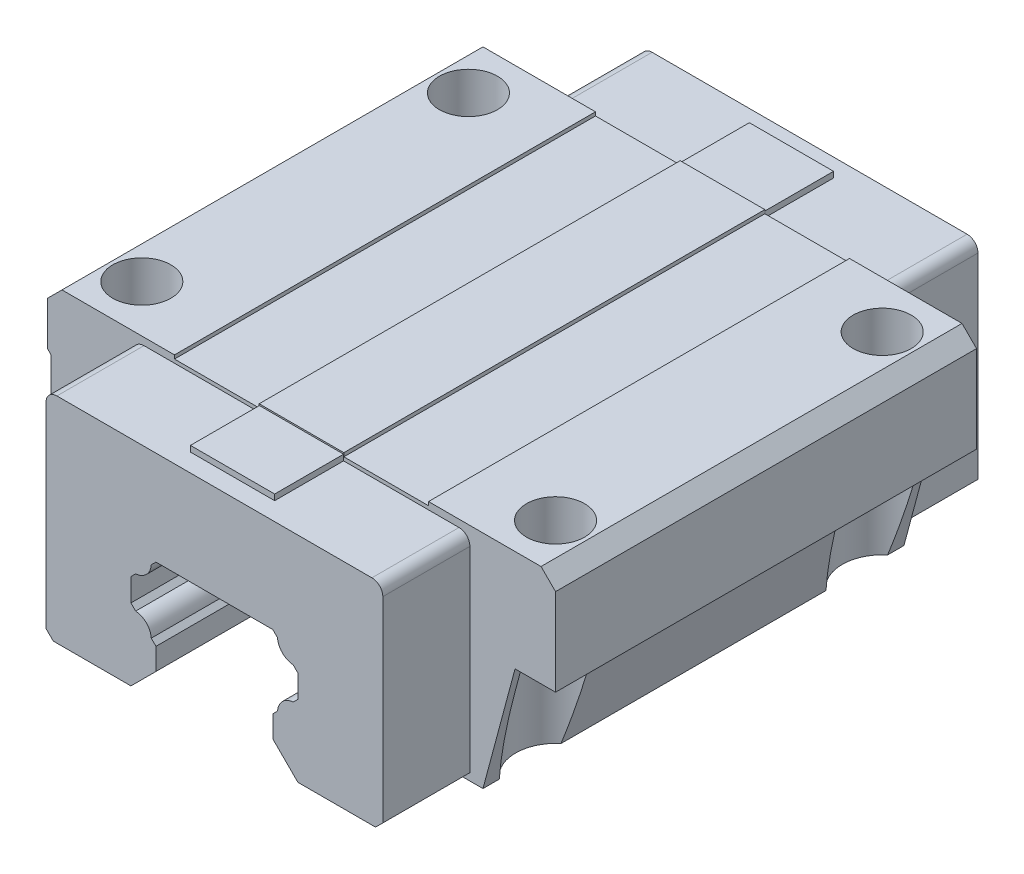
ISO-10303-21;
HEADER;
FILE_DESCRIPTION(('STEP AP214'),'2;1');
FILE_NAME('part.step','',(''),(''),'','','');
FILE_SCHEMA(('AUTOMOTIVE_DESIGN { 1 0 10303 214 1 1 1 1 }'));
ENDSEC;
DATA;
#1=APPLICATION_CONTEXT('core data for automotive mechanical design processes');
#2=APPLICATION_PROTOCOL_DEFINITION('international standard','automotive_design',2000,#1);
#3=PRODUCT_CONTEXT('',#1,'mechanical');
#4=PRODUCT('Part','Part','',(#3));
#5=PRODUCT_RELATED_PRODUCT_CATEGORY('part','',(#4));
#6=PRODUCT_DEFINITION_FORMATION('','',#4);
#7=PRODUCT_DEFINITION_CONTEXT('part definition',#1,'design');
#8=PRODUCT_DEFINITION('design','',#6,#7);
#9=PRODUCT_DEFINITION_SHAPE('','',#8);
#10=(LENGTH_UNIT() NAMED_UNIT(*) SI_UNIT(.MILLI.,.METRE.));
#11=(NAMED_UNIT(*) PLANE_ANGLE_UNIT() SI_UNIT($,.RADIAN.));
#12=(NAMED_UNIT(*) SI_UNIT($,.STERADIAN.) SOLID_ANGLE_UNIT());
#13=UNCERTAINTY_MEASURE_WITH_UNIT(LENGTH_MEASURE(1.E-05),#10,'distance_accuracy_value','');
#14=(GEOMETRIC_REPRESENTATION_CONTEXT(3) GLOBAL_UNCERTAINTY_ASSIGNED_CONTEXT((#13)) GLOBAL_UNIT_ASSIGNED_CONTEXT((#10,
#11,#12)) REPRESENTATION_CONTEXT('',''));
#15=CARTESIAN_POINT('',(0.,0.,0.));
#16=DIRECTION('',(0.,0.,1.));
#17=DIRECTION('',(1.,0.,0.));
#18=AXIS2_PLACEMENT_3D('',#15,#16,#17);
#19=CARTESIAN_POINT('',(-35.,28.,-38.50005));
#20=DIRECTION('',(0.707106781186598,0.707106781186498,0.));
#21=DIRECTION('',(-0.707106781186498,0.707106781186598,0.));
#22=AXIS2_PLACEMENT_3D('',#19,#20,#21);
#23=PLANE('',#22);
#24=DIRECTION('',(-0.707106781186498,0.707106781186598,0.));
#25=VECTOR('',#24,1.);
#26=CARTESIAN_POINT('',(-35.,28.,-29.));
#27=LINE('',#26,#25);
#28=CARTESIAN_POINT('',(-34.5,27.5,-29.));
#29=VERTEX_POINT('',#28);
#30=CARTESIAN_POINT('',(-35.,28.,-29.));
#31=VERTEX_POINT('',#30);
#32=EDGE_CURVE('E802',#29,#31,#27,.T.);
#33=ORIENTED_EDGE('',*,*,#32,.F.);
#34=DIRECTION('',(0.,0.,-1.));
#35=VECTOR('',#34,1.);
#36=CARTESIAN_POINT('',(-34.5,27.5,-38.50005));
#37=LINE('',#36,#35);
#38=CARTESIAN_POINT('',(-34.5,27.5,29.));
#39=VERTEX_POINT('',#38);
#40=EDGE_CURVE('E706',#29,#39,#37,.F.);
#41=ORIENTED_EDGE('',*,*,#40,.T.);
#42=DIRECTION('',(-0.707106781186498,0.707106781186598,0.));
#43=VECTOR('',#42,1.);
#44=CARTESIAN_POINT('',(-35.,28.,29.));
#45=LINE('',#44,#43);
#46=CARTESIAN_POINT('',(-35.,28.,29.));
#47=VERTEX_POINT('',#46);
#48=EDGE_CURVE('E811',#47,#39,#45,.F.);
#49=ORIENTED_EDGE('',*,*,#48,.F.);
#50=DIRECTION('',(0.,0.,-1.));
#51=VECTOR('',#50,1.);
#52=CARTESIAN_POINT('',(-35.,28.,105.3560737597));
#53=LINE('',#52,#51);
#54=EDGE_CURVE('E710',#47,#31,#53,.T.);
#55=ORIENTED_EDGE('',*,*,#54,.T.);
#56=EDGE_LOOP('',(#33,#41,#49,#55));
#57=FACE_BOUND('',#56,.T.);
#58=ADVANCED_FACE('F15',(#57),#23,.F.);
#59=CARTESIAN_POINT('',(28.5,36.,22.5));
#60=DIRECTION('',(0.,1.,0.));
#61=DIRECTION('',(0.,0.,1.));
#62=AXIS2_PLACEMENT_3D('',#59,#60,#61);
#63=CYLINDRICAL_SURFACE('',#62,4.);
#64=CARTESIAN_POINT('',(28.5,36.,22.5));
#65=DIRECTION('',(0.,1.,0.));
#66=DIRECTION('',(0.,0.,1.));
#67=AXIS2_PLACEMENT_3D('',#64,#65,#66);
#68=CIRCLE('',#67,4.);
#69=CARTESIAN_POINT('',(28.5,36.,26.5));
#70=VERTEX_POINT('',#69);
#71=EDGE_CURVE('E663',#70,#70,#68,.T.);
#72=ORIENTED_EDGE('',*,*,#71,.T.);
#73=EDGE_LOOP('',(#72));
#74=FACE_BOUND('',#73,.T.);
#75=CARTESIAN_POINT('',(28.5,22.,22.5));
#76=DIRECTION('',(0.,1.,0.));
#77=DIRECTION('',(0.,0.,1.));
#78=AXIS2_PLACEMENT_3D('',#75,#76,#77);
#79=CIRCLE('',#78,4.);
#80=CARTESIAN_POINT('',(28.5,22.,26.5));
#81=VERTEX_POINT('',#80);
#82=EDGE_CURVE('E671',#81,#81,#79,.F.);
#83=ORIENTED_EDGE('',*,*,#82,.T.);
#84=EDGE_LOOP('',(#83));
#85=FACE_BOUND('',#84,.T.);
#86=ADVANCED_FACE('F1881',(#74,#85),#63,.F.);
#87=CARTESIAN_POINT('',(28.5,36.,-22.5));
#88=DIRECTION('',(0.,1.,0.));
#89=DIRECTION('',(0.,0.,1.));
#90=AXIS2_PLACEMENT_3D('',#87,#88,#89);
#91=CYLINDRICAL_SURFACE('',#90,4.);
#92=CARTESIAN_POINT('',(28.5,36.,-22.5));
#93=DIRECTION('',(0.,1.,0.));
#94=DIRECTION('',(0.,0.,1.));
#95=AXIS2_PLACEMENT_3D('',#92,#93,#94);
#96=CIRCLE('',#95,4.);
#97=CARTESIAN_POINT('',(28.5,36.,-18.5));
#98=VERTEX_POINT('',#97);
#99=EDGE_CURVE('E659',#98,#98,#96,.T.);
#100=ORIENTED_EDGE('',*,*,#99,.T.);
#101=EDGE_LOOP('',(#100));
#102=FACE_BOUND('',#101,.T.);
#103=CARTESIAN_POINT('',(28.5,22.,-22.5));
#104=DIRECTION('',(0.,1.,0.));
#105=DIRECTION('',(0.,0.,1.));
#106=AXIS2_PLACEMENT_3D('',#103,#104,#105);
#107=CIRCLE('',#106,4.);
#108=CARTESIAN_POINT('',(28.5,22.,-18.5));
#109=VERTEX_POINT('',#108);
#110=EDGE_CURVE('E667',#109,#109,#107,.F.);
#111=ORIENTED_EDGE('',*,*,#110,.T.);
#112=EDGE_LOOP('',(#111));
#113=FACE_BOUND('',#112,.T.);
#114=ADVANCED_FACE('F1879',(#102,#113),#91,.F.);
#115=CARTESIAN_POINT('',(17.5,35.5,-29.));
#116=DIRECTION('',(1.,0.,0.));
#117=DIRECTION('',(0.,0.,-1.));
#118=AXIS2_PLACEMENT_3D('',#115,#116,#117);
#119=PLANE('',#118);
#120=DIRECTION('',(0.,0.,-1.));
#121=VECTOR('',#120,1.);
#122=CARTESIAN_POINT('',(17.5,35.5,29.));
#123=LINE('',#122,#121);
#124=CARTESIAN_POINT('',(17.5,35.5,-29.));
#125=VERTEX_POINT('',#124);
#126=CARTESIAN_POINT('',(17.5,35.5,29.));
#127=VERTEX_POINT('',#126);
#128=EDGE_CURVE('E662',#125,#127,#123,.F.);
#129=ORIENTED_EDGE('',*,*,#128,.T.);
#130=DIRECTION('',(0.,1.,0.));
#131=VECTOR('',#130,1.);
#132=CARTESIAN_POINT('',(17.5,35.5,29.));
#133=LINE('',#132,#131);
#134=CARTESIAN_POINT('',(17.5,36.,29.));
#135=VERTEX_POINT('',#134);
#136=EDGE_CURVE('E800',#135,#127,#133,.F.);
#137=ORIENTED_EDGE('',*,*,#136,.F.);
#138=DIRECTION('',(0.,0.,-1.));
#139=VECTOR('',#138,1.);
#140=CARTESIAN_POINT('',(17.5,36.,105.3560737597));
#141=LINE('',#140,#139);
#142=CARTESIAN_POINT('',(17.5,36.,-29.));
#143=VERTEX_POINT('',#142);
#144=EDGE_CURVE('E981',#135,#143,#141,.T.);
#145=ORIENTED_EDGE('',*,*,#144,.T.);
#146=DIRECTION('',(0.,1.,0.));
#147=VECTOR('',#146,1.);
#148=CARTESIAN_POINT('',(17.5,35.5,-29.));
#149=LINE('',#148,#147);
#150=EDGE_CURVE('E798',#125,#143,#149,.T.);
#151=ORIENTED_EDGE('',*,*,#150,.F.);
#152=EDGE_LOOP('',(#129,#137,#145,#151));
#153=FACE_BOUND('',#152,.T.);
#154=ADVANCED_FACE('F1572',(#153),#119,.F.);
#155=CARTESIAN_POINT('',(5.833333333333,35.5,-29.));
#156=DIRECTION('',(-1.,0.,0.));
#157=DIRECTION('',(0.,0.,1.));
#158=AXIS2_PLACEMENT_3D('',#155,#156,#157);
#159=PLANE('',#158);
#160=DIRECTION('',(0.,0.,-1.));
#161=VECTOR('',#160,1.);
#162=CARTESIAN_POINT('',(5.833333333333,35.5,29.));
#163=LINE('',#162,#161);
#164=CARTESIAN_POINT('',(5.833333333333,35.5,29.));
#165=VERTEX_POINT('',#164);
#166=CARTESIAN_POINT('',(5.833333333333,35.5,-29.));
#167=VERTEX_POINT('',#166);
#168=EDGE_CURVE('E974',#165,#167,#163,.T.);
#169=ORIENTED_EDGE('',*,*,#168,.T.);
#170=DIRECTION('',(0.,1.,0.));
#171=VECTOR('',#170,1.);
#172=CARTESIAN_POINT('',(5.833333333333,35.5,-29.));
#173=LINE('',#172,#171);
#174=CARTESIAN_POINT('',(5.833333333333,36.,-29.));
#175=VERTEX_POINT('',#174);
#176=EDGE_CURVE('E796',#175,#167,#173,.F.);
#177=ORIENTED_EDGE('',*,*,#176,.F.);
#178=DIRECTION('',(0.,0.,-1.));
#179=VECTOR('',#178,1.);
#180=CARTESIAN_POINT('',(5.833333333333,36.,105.3560737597));
#181=LINE('',#180,#179);
#182=CARTESIAN_POINT('',(5.833333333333,36.,29.));
#183=VERTEX_POINT('',#182);
#184=EDGE_CURVE('E971',#175,#183,#181,.F.);
#185=ORIENTED_EDGE('',*,*,#184,.T.);
#186=DIRECTION('',(0.,1.,0.));
#187=VECTOR('',#186,1.);
#188=CARTESIAN_POINT('',(5.833333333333,35.5,29.));
#189=LINE('',#188,#187);
#190=EDGE_CURVE('E794',#165,#183,#189,.T.);
#191=ORIENTED_EDGE('',*,*,#190,.F.);
#192=EDGE_LOOP('',(#169,#177,#185,#191));
#193=FACE_BOUND('',#192,.T.);
#194=ADVANCED_FACE('F1582',(#193),#159,.F.);
#195=CARTESIAN_POINT('',(-5.833333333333,35.5,-29.));
#196=DIRECTION('',(1.,0.,0.));
#197=DIRECTION('',(0.,0.,-1.));
#198=AXIS2_PLACEMENT_3D('',#195,#196,#197);
#199=PLANE('',#198);
#200=DIRECTION('',(0.,0.,-1.));
#201=VECTOR('',#200,1.);
#202=CARTESIAN_POINT('',(-5.833333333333,35.5,-29.));
#203=LINE('',#202,#201);
#204=CARTESIAN_POINT('',(-5.833333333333,35.5,-29.));
#205=VERTEX_POINT('',#204);
#206=CARTESIAN_POINT('',(-5.833333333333,35.5,29.));
#207=VERTEX_POINT('',#206);
#208=EDGE_CURVE('E965',#205,#207,#203,.F.);
#209=ORIENTED_EDGE('',*,*,#208,.T.);
#210=DIRECTION('',(0.,1.,0.));
#211=VECTOR('',#210,1.);
#212=CARTESIAN_POINT('',(-5.833333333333,35.5,29.));
#213=LINE('',#212,#211);
#214=CARTESIAN_POINT('',(-5.833333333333,36.,29.));
#215=VERTEX_POINT('',#214);
#216=EDGE_CURVE('E792',#215,#207,#213,.F.);
#217=ORIENTED_EDGE('',*,*,#216,.F.);
#218=DIRECTION('',(0.,0.,-1.));
#219=VECTOR('',#218,1.);
#220=CARTESIAN_POINT('',(-5.833333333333,36.,105.3560737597));
#221=LINE('',#220,#219);
#222=CARTESIAN_POINT('',(-5.833333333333,36.,-29.));
#223=VERTEX_POINT('',#222);
#224=EDGE_CURVE('E968',#215,#223,#221,.T.);
#225=ORIENTED_EDGE('',*,*,#224,.T.);
#226=DIRECTION('',(0.,1.,0.));
#227=VECTOR('',#226,1.);
#228=CARTESIAN_POINT('',(-5.833333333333,35.5,-29.));
#229=LINE('',#228,#227);
#230=EDGE_CURVE('E790',#205,#223,#229,.T.);
#231=ORIENTED_EDGE('',*,*,#230,.F.);
#232=EDGE_LOOP('',(#209,#217,#225,#231));
#233=FACE_BOUND('',#232,.T.);
#234=ADVANCED_FACE('F1588',(#233),#199,.F.);
#235=CARTESIAN_POINT('',(-17.5,35.5,-29.));
#236=DIRECTION('',(-1.,0.,0.));
#237=DIRECTION('',(0.,0.,1.));
#238=AXIS2_PLACEMENT_3D('',#235,#236,#237);
#239=PLANE('',#238);
#240=DIRECTION('',(0.,0.,-1.));
#241=VECTOR('',#240,1.);
#242=CARTESIAN_POINT('',(-17.5,35.5,-29.));
#243=LINE('',#242,#241);
#244=CARTESIAN_POINT('',(-17.5,35.5,29.));
#245=VERTEX_POINT('',#244);
#246=CARTESIAN_POINT('',(-17.5,35.5,-29.));
#247=VERTEX_POINT('',#246);
#248=EDGE_CURVE('E962',#245,#247,#243,.T.);
#249=ORIENTED_EDGE('',*,*,#248,.T.);
#250=DIRECTION('',(0.,1.,0.));
#251=VECTOR('',#250,1.);
#252=CARTESIAN_POINT('',(-17.5,35.5,-29.));
#253=LINE('',#252,#251);
#254=CARTESIAN_POINT('',(-17.5,36.,-29.));
#255=VERTEX_POINT('',#254);
#256=EDGE_CURVE('E788',#255,#247,#253,.F.);
#257=ORIENTED_EDGE('',*,*,#256,.F.);
#258=DIRECTION('',(0.,0.,-1.));
#259=VECTOR('',#258,1.);
#260=CARTESIAN_POINT('',(-17.5,36.,105.3560737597));
#261=LINE('',#260,#259);
#262=CARTESIAN_POINT('',(-17.5,36.,29.));
#263=VERTEX_POINT('',#262);
#264=EDGE_CURVE('E658',#255,#263,#261,.F.);
#265=ORIENTED_EDGE('',*,*,#264,.T.);
#266=DIRECTION('',(0.,1.,0.));
#267=VECTOR('',#266,1.);
#268=CARTESIAN_POINT('',(-17.5,35.5,29.));
#269=LINE('',#268,#267);
#270=EDGE_CURVE('E786',#245,#263,#269,.T.);
#271=ORIENTED_EDGE('',*,*,#270,.F.);
#272=EDGE_LOOP('',(#249,#257,#265,#271));
#273=FACE_BOUND('',#272,.T.);
#274=ADVANCED_FACE('F1596',(#273),#239,.F.);
#275=CARTESIAN_POINT('',(-28.5,36.,-22.5));
#276=DIRECTION('',(0.,1.,0.));
#277=DIRECTION('',(0.,0.,1.));
#278=AXIS2_PLACEMENT_3D('',#275,#276,#277);
#279=CYLINDRICAL_SURFACE('',#278,4.);
#280=CARTESIAN_POINT('',(-28.5,36.,-22.5));
#281=DIRECTION('',(0.,1.,0.));
#282=DIRECTION('',(0.,0.,1.));
#283=AXIS2_PLACEMENT_3D('',#280,#281,#282);
#284=CIRCLE('',#283,4.);
#285=CARTESIAN_POINT('',(-28.5,36.,-18.5));
#286=VERTEX_POINT('',#285);
#287=EDGE_CURVE('E655',#286,#286,#284,.T.);
#288=ORIENTED_EDGE('',*,*,#287,.T.);
#289=EDGE_LOOP('',(#288));
#290=FACE_BOUND('',#289,.T.);
#291=CARTESIAN_POINT('',(-28.5,22.,-22.5));
#292=DIRECTION('',(0.,1.,0.));
#293=DIRECTION('',(0.,0.,1.));
#294=AXIS2_PLACEMENT_3D('',#291,#292,#293);
#295=CIRCLE('',#294,4.);
#296=CARTESIAN_POINT('',(-28.5,22.,-18.5));
#297=VERTEX_POINT('',#296);
#298=EDGE_CURVE('E18',#297,#297,#295,.F.);
#299=ORIENTED_EDGE('',*,*,#298,.T.);
#300=EDGE_LOOP('',(#299));
#301=FACE_BOUND('',#300,.T.);
#302=ADVANCED_FACE('F1866',(#290,#301),#279,.F.);
#303=CARTESIAN_POINT('',(-28.5,36.,22.5));
#304=DIRECTION('',(0.,1.,0.));
#305=DIRECTION('',(0.,0.,1.));
#306=AXIS2_PLACEMENT_3D('',#303,#304,#305);
#307=CYLINDRICAL_SURFACE('',#306,4.);
#308=CARTESIAN_POINT('',(-28.5,36.,22.5));
#309=DIRECTION('',(0.,1.,0.));
#310=DIRECTION('',(0.,0.,1.));
#311=AXIS2_PLACEMENT_3D('',#308,#309,#310);
#312=CIRCLE('',#311,4.);
#313=CARTESIAN_POINT('',(-28.5,36.,26.5));
#314=VERTEX_POINT('',#313);
#315=EDGE_CURVE('E651',#314,#314,#312,.T.);
#316=ORIENTED_EDGE('',*,*,#315,.T.);
#317=EDGE_LOOP('',(#316));
#318=FACE_BOUND('',#317,.T.);
#319=CARTESIAN_POINT('',(-28.5,22.,22.5));
#320=DIRECTION('',(0.,1.,0.));
#321=DIRECTION('',(0.,0.,1.));
#322=AXIS2_PLACEMENT_3D('',#319,#320,#321);
#323=CIRCLE('',#322,4.);
#324=CARTESIAN_POINT('',(-28.5,22.,26.5));
#325=VERTEX_POINT('',#324);
#326=EDGE_CURVE('E674',#325,#325,#323,.F.);
#327=ORIENTED_EDGE('',*,*,#326,.T.);
#328=EDGE_LOOP('',(#327));
#329=FACE_BOUND('',#328,.T.);
#330=ADVANCED_FACE('F1862',(#318,#329),#307,.F.);
#331=CARTESIAN_POINT('',(-28.5,5.5,-28.));
#332=DIRECTION('',(0.,0.,-1.));
#333=DIRECTION('',(-1.,0.,0.));
#334=AXIS2_PLACEMENT_3D('',#331,#332,#333);
#335=PLANE('',#334);
#336=DIRECTION('',(0.,1.,0.));
#337=VECTOR('',#336,1.);
#338=CARTESIAN_POINT('',(-28.5,5.5,-28.));
#339=LINE('',#338,#337);
#340=CARTESIAN_POINT('',(-28.5,18.5621778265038,-28.));
#341=VERTEX_POINT('',#340);
#342=CARTESIAN_POINT('',(-28.5,22.,-28.));
#343=VERTEX_POINT('',#342);
#344=EDGE_CURVE('E642',#341,#343,#339,.T.);
#345=ORIENTED_EDGE('',*,*,#344,.T.);
#346=DIRECTION('',(1.,0.,0.));
#347=VECTOR('',#346,1.);
#348=CARTESIAN_POINT('',(-35.,22.,-28.));
#349=LINE('',#348,#347);
#350=CARTESIAN_POINT('',(-29.42116167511,22.,-28.));
#351=VERTEX_POINT('',#350);
#352=EDGE_CURVE('E687',#343,#351,#349,.F.);
#353=ORIENTED_EDGE('',*,*,#352,.T.);
#354=DIRECTION('',(-0.258819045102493,0.965925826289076,0.));
#355=VECTOR('',#354,1.);
#356=CARTESIAN_POINT('',(-29.42116167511,22.,-28.));
#357=LINE('',#356,#355);
#358=EDGE_CURVE('E649',#351,#341,#357,.F.);
#359=ORIENTED_EDGE('',*,*,#358,.T.);
#360=EDGE_LOOP('',(#345,#353,#359));
#361=FACE_BOUND('',#360,.T.);
#362=ADVANCED_FACE('F1858',(#361),#335,.F.);
#363=CARTESIAN_POINT('',(-35.,5.5,-17.));
#364=DIRECTION('',(0.,0.,1.));
#365=DIRECTION('',(1.,0.,0.));
#366=AXIS2_PLACEMENT_3D('',#363,#364,#365);
#367=PLANE('',#366);
#368=DIRECTION('',(-0.258819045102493,0.965925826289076,0.));
#369=VECTOR('',#368,1.);
#370=CARTESIAN_POINT('',(-29.42116167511,22.,-17.));
#371=LINE('',#370,#369);
#372=CARTESIAN_POINT('',(-28.5,18.5621778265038,-17.));
#373=VERTEX_POINT('',#372);
#374=CARTESIAN_POINT('',(-29.42116167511,22.,-17.));
#375=VERTEX_POINT('',#374);
#376=EDGE_CURVE('E641',#373,#375,#371,.T.);
#377=ORIENTED_EDGE('',*,*,#376,.T.);
#378=DIRECTION('',(1.,0.,0.));
#379=VECTOR('',#378,1.);
#380=CARTESIAN_POINT('',(-35.,22.,-17.));
#381=LINE('',#380,#379);
#382=CARTESIAN_POINT('',(-28.5,22.,-17.));
#383=VERTEX_POINT('',#382);
#384=EDGE_CURVE('E693',#375,#383,#381,.T.);
#385=ORIENTED_EDGE('',*,*,#384,.T.);
#386=DIRECTION('',(0.,1.,0.));
#387=VECTOR('',#386,1.);
#388=CARTESIAN_POINT('',(-28.5,5.5,-17.));
#389=LINE('',#388,#387);
#390=EDGE_CURVE('E646',#383,#373,#389,.F.);
#391=ORIENTED_EDGE('',*,*,#390,.T.);
#392=EDGE_LOOP('',(#377,#385,#391));
#393=FACE_BOUND('',#392,.T.);
#394=ADVANCED_FACE('F1855',(#393),#367,.F.);
#395=CARTESIAN_POINT('',(-35.,5.5,17.));
#396=DIRECTION('',(0.,0.,-1.));
#397=DIRECTION('',(-1.,0.,0.));
#398=AXIS2_PLACEMENT_3D('',#395,#396,#397);
#399=PLANE('',#398);
#400=DIRECTION('',(0.,1.,0.));
#401=VECTOR('',#400,1.);
#402=CARTESIAN_POINT('',(-28.5,5.5,17.));
#403=LINE('',#402,#401);
#404=CARTESIAN_POINT('',(-28.5,18.5621778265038,17.));
#405=VERTEX_POINT('',#404);
#406=CARTESIAN_POINT('',(-28.5,22.,17.));
#407=VERTEX_POINT('',#406);
#408=EDGE_CURVE('E632',#405,#407,#403,.T.);
#409=ORIENTED_EDGE('',*,*,#408,.T.);
#410=DIRECTION('',(1.,0.,0.));
#411=VECTOR('',#410,1.);
#412=CARTESIAN_POINT('',(-35.,22.,17.));
#413=LINE('',#412,#411);
#414=CARTESIAN_POINT('',(-29.42116167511,22.,17.));
#415=VERTEX_POINT('',#414);
#416=EDGE_CURVE('E1035',#407,#415,#413,.F.);
#417=ORIENTED_EDGE('',*,*,#416,.T.);
#418=DIRECTION('',(-0.258819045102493,0.965925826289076,0.));
#419=VECTOR('',#418,1.);
#420=CARTESIAN_POINT('',(-29.42116167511,22.,17.));
#421=LINE('',#420,#419);
#422=EDGE_CURVE('E637',#415,#405,#421,.F.);
#423=ORIENTED_EDGE('',*,*,#422,.T.);
#424=EDGE_LOOP('',(#409,#417,#423));
#425=FACE_BOUND('',#424,.T.);
#426=ADVANCED_FACE('F1057',(#425),#399,.F.);
#427=CARTESIAN_POINT('',(-28.5,5.5,28.));
#428=DIRECTION('',(0.,0.,1.));
#429=DIRECTION('',(1.,0.,0.));
#430=AXIS2_PLACEMENT_3D('',#427,#428,#429);
#431=PLANE('',#430);
#432=DIRECTION('',(-0.258819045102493,0.965925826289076,0.));
#433=VECTOR('',#432,1.);
#434=CARTESIAN_POINT('',(-29.42116167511,22.,28.));
#435=LINE('',#434,#433);
#436=CARTESIAN_POINT('',(-28.5,18.5621778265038,28.));
#437=VERTEX_POINT('',#436);
#438=CARTESIAN_POINT('',(-29.42116167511,22.,28.));
#439=VERTEX_POINT('',#438);
#440=EDGE_CURVE('E758',#437,#439,#435,.T.);
#441=ORIENTED_EDGE('',*,*,#440,.T.);
#442=DIRECTION('',(1.,0.,0.));
#443=VECTOR('',#442,1.);
#444=CARTESIAN_POINT('',(-35.,22.,28.));
#445=LINE('',#444,#443);
#446=CARTESIAN_POINT('',(-28.5,22.,28.));
#447=VERTEX_POINT('',#446);
#448=EDGE_CURVE('E709',#439,#447,#445,.T.);
#449=ORIENTED_EDGE('',*,*,#448,.T.);
#450=DIRECTION('',(0.,1.,0.));
#451=VECTOR('',#450,1.);
#452=CARTESIAN_POINT('',(-28.5,5.5,28.));
#453=LINE('',#452,#451);
#454=EDGE_CURVE('E633',#447,#437,#453,.F.);
#455=ORIENTED_EDGE('',*,*,#454,.T.);
#456=EDGE_LOOP('',(#441,#449,#455));
#457=FACE_BOUND('',#456,.T.);
#458=ADVANCED_FACE('F1044',(#457),#431,.F.);
#459=CARTESIAN_POINT('',(-5.8,35.8,50.127553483));
#460=DIRECTION('',(0.,-1.,0.));
#461=DIRECTION('',(0.,0.,-1.));
#462=AXIS2_PLACEMENT_3D('',#459,#460,#461);
#463=PLANE('',#462);
#464=DIRECTION('',(0.,0.,-1.));
#465=VECTOR('',#464,1.);
#466=CARTESIAN_POINT('',(-5.8,35.8,50.127553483));
#467=LINE('',#466,#465);
#468=CARTESIAN_POINT('',(-5.8,35.8,29.));
#469=VERTEX_POINT('',#468);
#470=CARTESIAN_POINT('',(-5.8,35.8,38.5));
#471=VERTEX_POINT('',#470);
#472=EDGE_CURVE('E624',#469,#471,#467,.F.);
#473=ORIENTED_EDGE('',*,*,#472,.T.);
#474=DIRECTION('',(1.,0.,0.));
#475=VECTOR('',#474,1.);
#476=CARTESIAN_POINT('',(0.,35.8,38.5));
#477=LINE('',#476,#475);
#478=CARTESIAN_POINT('',(5.8,35.8,38.5));
#479=VERTEX_POINT('',#478);
#480=EDGE_CURVE('E753',#479,#471,#477,.F.);
#481=ORIENTED_EDGE('',*,*,#480,.F.);
#482=DIRECTION('',(0.,0.,1.));
#483=VECTOR('',#482,1.);
#484=CARTESIAN_POINT('',(5.8,35.8,50.127553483));
#485=LINE('',#484,#483);
#486=CARTESIAN_POINT('',(5.8,35.8,29.));
#487=VERTEX_POINT('',#486);
#488=EDGE_CURVE('E621',#479,#487,#485,.F.);
#489=ORIENTED_EDGE('',*,*,#488,.T.);
#490=DIRECTION('',(1.,0.,0.));
#491=VECTOR('',#490,1.);
#492=CARTESIAN_POINT('',(0.,35.8,29.));
#493=LINE('',#492,#491);
#494=EDGE_CURVE('E745',#469,#487,#493,.T.);
#495=ORIENTED_EDGE('',*,*,#494,.F.);
#496=EDGE_LOOP('',(#473,#481,#489,#495));
#497=FACE_BOUND('',#496,.T.);
#498=ADVANCED_FACE('F1532',(#497),#463,.F.);
#499=CARTESIAN_POINT('',(28.5,5.5,28.));
#500=DIRECTION('',(0.,0.,1.));
#501=DIRECTION('',(1.,0.,0.));
#502=AXIS2_PLACEMENT_3D('',#499,#500,#501);
#503=PLANE('',#502);
#504=DIRECTION('',(0.,1.,0.));
#505=VECTOR('',#504,1.);
#506=CARTESIAN_POINT('',(28.5,5.5,28.));
#507=LINE('',#506,#505);
#508=CARTESIAN_POINT('',(28.5,18.5621778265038,28.));
#509=VERTEX_POINT('',#508);
#510=CARTESIAN_POINT('',(28.5,22.,28.));
#511=VERTEX_POINT('',#510);
#512=EDGE_CURVE('E611',#509,#511,#507,.T.);
#513=ORIENTED_EDGE('',*,*,#512,.T.);
#514=DIRECTION('',(1.,0.,0.));
#515=VECTOR('',#514,1.);
#516=CARTESIAN_POINT('',(35.,22.,28.));
#517=LINE('',#516,#515);
#518=CARTESIAN_POINT('',(29.42116167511,22.,28.));
#519=VERTEX_POINT('',#518);
#520=EDGE_CURVE('E680',#511,#519,#517,.T.);
#521=ORIENTED_EDGE('',*,*,#520,.T.);
#522=DIRECTION('',(-0.258819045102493,-0.965925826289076,0.));
#523=VECTOR('',#522,1.);
#524=CARTESIAN_POINT('',(29.42116167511,22.,28.));
#525=LINE('',#524,#523);
#526=EDGE_CURVE('E721',#519,#509,#525,.T.);
#527=ORIENTED_EDGE('',*,*,#526,.T.);
#528=EDGE_LOOP('',(#513,#521,#527));
#529=FACE_BOUND('',#528,.T.);
#530=ADVANCED_FACE('F1834',(#529),#503,.F.);
#531=CARTESIAN_POINT('',(35.,5.5,17.));
#532=DIRECTION('',(0.,0.,-1.));
#533=DIRECTION('',(-1.,0.,0.));
#534=AXIS2_PLACEMENT_3D('',#531,#532,#533);
#535=PLANE('',#534);
#536=DIRECTION('',(-0.258819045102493,-0.965925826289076,0.));
#537=VECTOR('',#536,1.);
#538=CARTESIAN_POINT('',(29.42116167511,22.,17.));
#539=LINE('',#538,#537);
#540=CARTESIAN_POINT('',(28.5,18.5621778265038,17.));
#541=VERTEX_POINT('',#540);
#542=CARTESIAN_POINT('',(29.42116167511,22.,17.));
#543=VERTEX_POINT('',#542);
#544=EDGE_CURVE('E607',#541,#543,#539,.F.);
#545=ORIENTED_EDGE('',*,*,#544,.T.);
#546=DIRECTION('',(1.,0.,0.));
#547=VECTOR('',#546,1.);
#548=CARTESIAN_POINT('',(35.,22.,17.));
#549=LINE('',#548,#547);
#550=CARTESIAN_POINT('',(28.5,22.,17.));
#551=VERTEX_POINT('',#550);
#552=EDGE_CURVE('E676',#543,#551,#549,.F.);
#553=ORIENTED_EDGE('',*,*,#552,.T.);
#554=DIRECTION('',(0.,1.,0.));
#555=VECTOR('',#554,1.);
#556=CARTESIAN_POINT('',(28.5,5.5,17.));
#557=LINE('',#556,#555);
#558=EDGE_CURVE('E615',#551,#541,#557,.F.);
#559=ORIENTED_EDGE('',*,*,#558,.T.);
#560=EDGE_LOOP('',(#545,#553,#559));
#561=FACE_BOUND('',#560,.T.);
#562=ADVANCED_FACE('F1836',(#561),#535,.F.);
#563=CARTESIAN_POINT('',(35.,5.5,-17.));
#564=DIRECTION('',(0.,0.,1.));
#565=DIRECTION('',(1.,0.,0.));
#566=AXIS2_PLACEMENT_3D('',#563,#564,#565);
#567=PLANE('',#566);
#568=DIRECTION('',(0.,1.,0.));
#569=VECTOR('',#568,1.);
#570=CARTESIAN_POINT('',(28.5,5.5,-17.));
#571=LINE('',#570,#569);
#572=CARTESIAN_POINT('',(28.5,18.5621778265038,-17.));
#573=VERTEX_POINT('',#572);
#574=CARTESIAN_POINT('',(28.5,22.,-17.));
#575=VERTEX_POINT('',#574);
#576=EDGE_CURVE('E598',#573,#575,#571,.T.);
#577=ORIENTED_EDGE('',*,*,#576,.T.);
#578=DIRECTION('',(1.,0.,0.));
#579=VECTOR('',#578,1.);
#580=CARTESIAN_POINT('',(35.,22.,-17.));
#581=LINE('',#580,#579);
#582=CARTESIAN_POINT('',(29.42116167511,22.,-17.));
#583=VERTEX_POINT('',#582);
#584=EDGE_CURVE('E673',#575,#583,#581,.T.);
#585=ORIENTED_EDGE('',*,*,#584,.T.);
#586=DIRECTION('',(-0.258819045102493,-0.965925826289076,0.));
#587=VECTOR('',#586,1.);
#588=CARTESIAN_POINT('',(29.42116167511,22.,-17.));
#589=LINE('',#588,#587);
#590=EDGE_CURVE('E603',#583,#573,#589,.T.);
#591=ORIENTED_EDGE('',*,*,#590,.T.);
#592=EDGE_LOOP('',(#577,#585,#591));
#593=FACE_BOUND('',#592,.T.);
#594=ADVANCED_FACE('F1838',(#593),#567,.F.);
#595=CARTESIAN_POINT('',(28.5,5.5,-28.));
#596=DIRECTION('',(0.,0.,-1.));
#597=DIRECTION('',(-1.,0.,0.));
#598=AXIS2_PLACEMENT_3D('',#595,#596,#597);
#599=PLANE('',#598);
#600=DIRECTION('',(-0.258819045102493,-0.965925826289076,0.));
#601=VECTOR('',#600,1.);
#602=CARTESIAN_POINT('',(29.42116167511,22.,-28.));
#603=LINE('',#602,#601);
#604=CARTESIAN_POINT('',(28.5,18.5621778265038,-28.));
#605=VERTEX_POINT('',#604);
#606=CARTESIAN_POINT('',(29.42116167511,22.,-28.));
#607=VERTEX_POINT('',#606);
#608=EDGE_CURVE('E999',#605,#607,#603,.F.);
#609=ORIENTED_EDGE('',*,*,#608,.T.);
#610=DIRECTION('',(1.,0.,0.));
#611=VECTOR('',#610,1.);
#612=CARTESIAN_POINT('',(35.,22.,-28.));
#613=LINE('',#612,#611);
#614=CARTESIAN_POINT('',(28.5,22.,-28.));
#615=VERTEX_POINT('',#614);
#616=EDGE_CURVE('E987',#607,#615,#613,.F.);
#617=ORIENTED_EDGE('',*,*,#616,.T.);
#618=DIRECTION('',(0.,1.,0.));
#619=VECTOR('',#618,1.);
#620=CARTESIAN_POINT('',(28.5,5.5,-28.));
#621=LINE('',#620,#619);
#622=EDGE_CURVE('E599',#615,#605,#621,.F.);
#623=ORIENTED_EDGE('',*,*,#622,.T.);
#624=EDGE_LOOP('',(#609,#617,#623));
#625=FACE_BOUND('',#624,.T.);
#626=ADVANCED_FACE('F1624',(#625),#599,.F.);
#627=CARTESIAN_POINT('',(-35.,36.,105.3560737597));
#628=DIRECTION('',(1.,0.,0.));
#629=DIRECTION('',(0.,0.,-1.));
#630=AXIS2_PLACEMENT_3D('',#627,#628,#629);
#631=PLANE('',#630);
#632=DIRECTION('',(0.,1.,0.));
#633=VECTOR('',#632,1.);
#634=CARTESIAN_POINT('',(-35.,0.,-29.));
#635=LINE('',#634,#633);
#636=CARTESIAN_POINT('',(-35.,34.,-29.));
#637=VERTEX_POINT('',#636);
#638=EDGE_CURVE('E593',#637,#31,#635,.F.);
#639=ORIENTED_EDGE('',*,*,#638,.T.);
#640=ORIENTED_EDGE('',*,*,#54,.F.);
#641=DIRECTION('',(0.,1.,0.));
#642=VECTOR('',#641,1.);
#643=CARTESIAN_POINT('',(-35.,0.,29.));
#644=LINE('',#643,#642);
#645=CARTESIAN_POINT('',(-35.,34.,29.));
#646=VERTEX_POINT('',#645);
#647=EDGE_CURVE('E768',#646,#47,#644,.F.);
#648=ORIENTED_EDGE('',*,*,#647,.F.);
#649=DIRECTION('',(0.,0.,1.));
#650=VECTOR('',#649,1.);
#651=CARTESIAN_POINT('',(-35.,34.,105.3560737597));
#652=LINE('',#651,#650);
#653=EDGE_CURVE('E654',#646,#637,#652,.F.);
#654=ORIENTED_EDGE('',*,*,#653,.T.);
#655=EDGE_LOOP('',(#639,#640,#648,#654));
#656=FACE_BOUND('',#655,.T.);
#657=ADVANCED_FACE('F1607',(#656),#631,.F.);
#658=CARTESIAN_POINT('',(-34.5,22.,-38.50005));
#659=DIRECTION('',(1.,0.,0.));
#660=DIRECTION('',(0.,0.,-1.));
#661=AXIS2_PLACEMENT_3D('',#658,#659,#660);
#662=PLANE('',#661);
#663=DIRECTION('',(0.,1.,0.));
#664=VECTOR('',#663,1.);
#665=CARTESIAN_POINT('',(-34.5,0.,-29.));
#666=LINE('',#665,#664);
#667=CARTESIAN_POINT('',(-34.5,22.,-29.));
#668=VERTEX_POINT('',#667);
#669=EDGE_CURVE('E701',#29,#668,#666,.F.);
#670=ORIENTED_EDGE('',*,*,#669,.T.);
#671=DIRECTION('',(0.,0.,1.));
#672=VECTOR('',#671,1.);
#673=CARTESIAN_POINT('',(-34.5,22.,-38.50005));
#674=LINE('',#673,#672);
#675=CARTESIAN_POINT('',(-34.5,22.,29.));
#676=VERTEX_POINT('',#675);
#677=EDGE_CURVE('E683',#668,#676,#674,.T.);
#678=ORIENTED_EDGE('',*,*,#677,.T.);
#679=DIRECTION('',(0.,1.,0.));
#680=VECTOR('',#679,1.);
#681=CARTESIAN_POINT('',(-34.5,0.,29.));
#682=LINE('',#681,#680);
#683=EDGE_CURVE('E764',#39,#676,#682,.F.);
#684=ORIENTED_EDGE('',*,*,#683,.F.);
#685=ORIENTED_EDGE('',*,*,#40,.F.);
#686=EDGE_LOOP('',(#670,#678,#684,#685));
#687=FACE_BOUND('',#686,.T.);
#688=ADVANCED_FACE('F1612',(#687),#662,.F.);
#689=CARTESIAN_POINT('',(-35.,22.,-38.50005));
#690=DIRECTION('',(0.,1.,0.));
#691=DIRECTION('',(0.,0.,1.));
#692=AXIS2_PLACEMENT_3D('',#689,#690,#691);
#693=PLANE('',#692);
#694=ORIENTED_EDGE('',*,*,#326,.F.);
#695=EDGE_LOOP('',(#694));
#696=FACE_BOUND('',#695,.T.);
#697=ORIENTED_EDGE('',*,*,#298,.F.);
#698=EDGE_LOOP('',(#697));
#699=FACE_BOUND('',#698,.T.);
#700=DIRECTION('',(1.,0.,0.));
#701=VECTOR('',#700,1.);
#702=CARTESIAN_POINT('',(0.,22.,-29.));
#703=LINE('',#702,#701);
#704=CARTESIAN_POINT('',(-29.42116167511,22.,-29.));
#705=VERTEX_POINT('',#704);
#706=EDGE_CURVE('E703',#668,#705,#703,.T.);
#707=ORIENTED_EDGE('',*,*,#706,.T.);
#708=DIRECTION('',(0.,0.,1.));
#709=VECTOR('',#708,1.);
#710=CARTESIAN_POINT('',(-29.42116167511,22.,-38.50005));
#711=LINE('',#710,#709);
#712=EDGE_CURVE('E518',#705,#351,#711,.T.);
#713=ORIENTED_EDGE('',*,*,#712,.T.);
#714=ORIENTED_EDGE('',*,*,#352,.F.);
#715=CARTESIAN_POINT('',(-28.5,22.,-22.5));
#716=DIRECTION('',(0.,1.,0.));
#717=DIRECTION('',(0.,0.,1.));
#718=AXIS2_PLACEMENT_3D('',#715,#716,#717);
#719=CIRCLE('',#718,5.5);
#720=EDGE_CURVE('E647',#343,#383,#719,.F.);
#721=ORIENTED_EDGE('',*,*,#720,.T.);
#722=ORIENTED_EDGE('',*,*,#384,.F.);
#723=DIRECTION('',(0.,0.,1.));
#724=VECTOR('',#723,1.);
#725=CARTESIAN_POINT('',(-29.42116167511,22.,-38.50005));
#726=LINE('',#725,#724);
#727=EDGE_CURVE('E775',#375,#415,#726,.T.);
#728=ORIENTED_EDGE('',*,*,#727,.T.);
#729=ORIENTED_EDGE('',*,*,#416,.F.);
#730=CARTESIAN_POINT('',(-28.5,22.,22.5));
#731=DIRECTION('',(0.,1.,0.));
#732=DIRECTION('',(0.,0.,1.));
#733=AXIS2_PLACEMENT_3D('',#730,#731,#732);
#734=CIRCLE('',#733,5.5);
#735=EDGE_CURVE('E634',#407,#447,#734,.F.);
#736=ORIENTED_EDGE('',*,*,#735,.T.);
#737=ORIENTED_EDGE('',*,*,#448,.F.);
#738=DIRECTION('',(0.,0.,1.));
#739=VECTOR('',#738,1.);
#740=CARTESIAN_POINT('',(-29.42116167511,22.,-38.50005));
#741=LINE('',#740,#739);
#742=CARTESIAN_POINT('',(-29.42116167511,22.,29.));
#743=VERTEX_POINT('',#742);
#744=EDGE_CURVE('E628',#439,#743,#741,.T.);
#745=ORIENTED_EDGE('',*,*,#744,.T.);
#746=DIRECTION('',(1.,0.,0.));
#747=VECTOR('',#746,1.);
#748=CARTESIAN_POINT('',(0.,22.,29.));
#749=LINE('',#748,#747);
#750=EDGE_CURVE('E761',#676,#743,#749,.T.);
#751=ORIENTED_EDGE('',*,*,#750,.F.);
#752=ORIENTED_EDGE('',*,*,#677,.F.);
#753=EDGE_LOOP('',(#707,#713,#714,#721,#722,#728,#729,#736,#737,#745,#751,#752));
#754=FACE_BOUND('',#753,.T.);
#755=ADVANCED_FACE('F1053',(#696,#699,#754),#693,.F.);
#756=CARTESIAN_POINT('',(-5.8,35.8,50.127553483));
#757=DIRECTION('',(0.,-1.,0.));
#758=DIRECTION('',(0.,0.,-1.));
#759=AXIS2_PLACEMENT_3D('',#756,#757,#758);
#760=PLANE('',#759);
#761=DIRECTION('',(1.,0.,0.));
#762=VECTOR('',#761,1.);
#763=CARTESIAN_POINT('',(0.,35.8,-38.5));
#764=LINE('',#763,#762);
#765=CARTESIAN_POINT('',(5.8,35.8,-38.5));
#766=VERTEX_POINT('',#765);
#767=CARTESIAN_POINT('',(-5.8,35.8,-38.5));
#768=VERTEX_POINT('',#767);
#769=EDGE_CURVE('E780',#766,#768,#764,.F.);
#770=ORIENTED_EDGE('',*,*,#769,.T.);
#771=DIRECTION('',(0.,0.,-1.));
#772=VECTOR('',#771,1.);
#773=CARTESIAN_POINT('',(-5.8,35.8,50.127553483));
#774=LINE('',#773,#772);
#775=CARTESIAN_POINT('',(-5.8,35.8,-29.));
#776=VERTEX_POINT('',#775);
#777=EDGE_CURVE('E1010',#768,#776,#774,.F.);
#778=ORIENTED_EDGE('',*,*,#777,.T.);
#779=DIRECTION('',(1.,0.,0.));
#780=VECTOR('',#779,1.);
#781=CARTESIAN_POINT('',(0.,35.8,-29.));
#782=LINE('',#781,#780);
#783=CARTESIAN_POINT('',(5.8,35.8,-29.));
#784=VERTEX_POINT('',#783);
#785=EDGE_CURVE('E1013',#776,#784,#782,.T.);
#786=ORIENTED_EDGE('',*,*,#785,.T.);
#787=DIRECTION('',(0.,0.,1.));
#788=VECTOR('',#787,1.);
#789=CARTESIAN_POINT('',(5.8,35.8,50.127553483));
#790=LINE('',#789,#788);
#791=EDGE_CURVE('E1007',#784,#766,#790,.F.);
#792=ORIENTED_EDGE('',*,*,#791,.T.);
#793=EDGE_LOOP('',(#770,#778,#786,#792));
#794=FACE_BOUND('',#793,.T.);
#795=ADVANCED_FACE('F1620',(#794),#760,.F.);
#796=CARTESIAN_POINT('',(35.,22.,-38.50005));
#797=DIRECTION('',(0.,1.,0.));
#798=DIRECTION('',(0.,0.,1.));
#799=AXIS2_PLACEMENT_3D('',#796,#797,#798);
#800=PLANE('',#799);
#801=ORIENTED_EDGE('',*,*,#110,.F.);
#802=EDGE_LOOP('',(#801));
#803=FACE_BOUND('',#802,.T.);
#804=ORIENTED_EDGE('',*,*,#82,.F.);
#805=EDGE_LOOP('',(#804));
#806=FACE_BOUND('',#805,.T.);
#807=CARTESIAN_POINT('',(28.5,22.,-22.5));
#808=DIRECTION('',(0.,1.,0.));
#809=DIRECTION('',(0.,0.,1.));
#810=AXIS2_PLACEMENT_3D('',#807,#808,#809);
#811=CIRCLE('',#810,5.5);
#812=EDGE_CURVE('E600',#575,#615,#811,.F.);
#813=ORIENTED_EDGE('',*,*,#812,.T.);
#814=ORIENTED_EDGE('',*,*,#616,.F.);
#815=DIRECTION('',(0.,0.,1.));
#816=VECTOR('',#815,1.);
#817=CARTESIAN_POINT('',(29.42116167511,22.,-38.50005));
#818=LINE('',#817,#816);
#819=CARTESIAN_POINT('',(29.42116167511,22.,-29.));
#820=VERTEX_POINT('',#819);
#821=EDGE_CURVE('E594',#607,#820,#818,.F.);
#822=ORIENTED_EDGE('',*,*,#821,.T.);
#823=DIRECTION('',(1.,0.,0.));
#824=VECTOR('',#823,1.);
#825=CARTESIAN_POINT('',(0.,22.,-29.));
#826=LINE('',#825,#824);
#827=CARTESIAN_POINT('',(35.,22.,-29.));
#828=VERTEX_POINT('',#827);
#829=EDGE_CURVE('E807',#820,#828,#826,.T.);
#830=ORIENTED_EDGE('',*,*,#829,.T.);
#831=DIRECTION('',(0.,0.,1.));
#832=VECTOR('',#831,1.);
#833=CARTESIAN_POINT('',(35.,22.,105.3560737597));
#834=LINE('',#833,#832);
#835=CARTESIAN_POINT('',(35.,22.,29.));
#836=VERTEX_POINT('',#835);
#837=EDGE_CURVE('E670',#828,#836,#834,.T.);
#838=ORIENTED_EDGE('',*,*,#837,.T.);
#839=DIRECTION('',(1.,0.,0.));
#840=VECTOR('',#839,1.);
#841=CARTESIAN_POINT('',(0.,22.,29.));
#842=LINE('',#841,#840);
#843=CARTESIAN_POINT('',(29.42116167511,22.,29.));
#844=VERTEX_POINT('',#843);
#845=EDGE_CURVE('E725',#844,#836,#842,.T.);
#846=ORIENTED_EDGE('',*,*,#845,.F.);
#847=DIRECTION('',(0.,0.,1.));
#848=VECTOR('',#847,1.);
#849=CARTESIAN_POINT('',(29.42116167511,22.,-38.50005));
#850=LINE('',#849,#848);
#851=EDGE_CURVE('E718',#844,#519,#850,.F.);
#852=ORIENTED_EDGE('',*,*,#851,.T.);
#853=ORIENTED_EDGE('',*,*,#520,.F.);
#854=CARTESIAN_POINT('',(28.5,22.,22.5));
#855=DIRECTION('',(0.,1.,0.));
#856=DIRECTION('',(0.,0.,1.));
#857=AXIS2_PLACEMENT_3D('',#854,#855,#856);
#858=CIRCLE('',#857,5.5);
#859=EDGE_CURVE('E608',#511,#551,#858,.F.);
#860=ORIENTED_EDGE('',*,*,#859,.T.);
#861=ORIENTED_EDGE('',*,*,#552,.F.);
#862=DIRECTION('',(0.,0.,1.));
#863=VECTOR('',#862,1.);
#864=CARTESIAN_POINT('',(29.42116167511,22.,-38.50005));
#865=LINE('',#864,#863);
#866=EDGE_CURVE('E713',#543,#583,#865,.F.);
#867=ORIENTED_EDGE('',*,*,#866,.T.);
#868=ORIENTED_EDGE('',*,*,#584,.F.);
#869=EDGE_LOOP('',(#813,#814,#822,#830,#838,#846,#852,#853,#860,#861,#867,#868));
#870=FACE_BOUND('',#869,.T.);
#871=ADVANCED_FACE('F1557',(#803,#806,#870),#800,.F.);
#872=CARTESIAN_POINT('',(35.,36.,105.3560737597));
#873=DIRECTION('',(-1.,0.,0.));
#874=DIRECTION('',(0.,0.,1.));
#875=AXIS2_PLACEMENT_3D('',#872,#873,#874);
#876=PLANE('',#875);
#877=DIRECTION('',(0.,1.,0.));
#878=VECTOR('',#877,1.);
#879=CARTESIAN_POINT('',(35.,0.,29.));
#880=LINE('',#879,#878);
#881=CARTESIAN_POINT('',(35.,34.,29.));
#882=VERTEX_POINT('',#881);
#883=EDGE_CURVE('E727',#836,#882,#880,.T.);
#884=ORIENTED_EDGE('',*,*,#883,.F.);
#885=ORIENTED_EDGE('',*,*,#837,.F.);
#886=DIRECTION('',(0.,1.,0.));
#887=VECTOR('',#886,1.);
#888=CARTESIAN_POINT('',(35.,0.,-29.));
#889=LINE('',#888,#887);
#890=CARTESIAN_POINT('',(35.,34.,-29.));
#891=VERTEX_POINT('',#890);
#892=EDGE_CURVE('E803',#828,#891,#889,.T.);
#893=ORIENTED_EDGE('',*,*,#892,.T.);
#894=DIRECTION('',(0.,0.,1.));
#895=VECTOR('',#894,1.);
#896=CARTESIAN_POINT('',(35.,34.,105.3560737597));
#897=LINE('',#896,#895);
#898=EDGE_CURVE('E733',#891,#882,#897,.T.);
#899=ORIENTED_EDGE('',*,*,#898,.T.);
#900=EDGE_LOOP('',(#884,#885,#893,#899));
#901=FACE_BOUND('',#900,.T.);
#902=ADVANCED_FACE('F1561',(#901),#876,.F.);
#903=CARTESIAN_POINT('',(33.,36.,105.3560737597));
#904=DIRECTION('',(-0.707106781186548,-0.707106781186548,0.));
#905=DIRECTION('',(0.707106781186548,-0.707106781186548,0.));
#906=AXIS2_PLACEMENT_3D('',#903,#904,#905);
#907=PLANE('',#906);
#908=DIRECTION('',(-0.707106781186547,0.707106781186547,0.));
#909=VECTOR('',#908,1.);
#910=CARTESIAN_POINT('',(35.,34.,-29.));
#911=LINE('',#910,#909);
#912=CARTESIAN_POINT('',(33.,36.,-29.));
#913=VERTEX_POINT('',#912);
#914=EDGE_CURVE('E806',#891,#913,#911,.T.);
#915=ORIENTED_EDGE('',*,*,#914,.T.);
#916=DIRECTION('',(0.,0.,-1.));
#917=VECTOR('',#916,1.);
#918=CARTESIAN_POINT('',(33.,36.,105.3560737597));
#919=LINE('',#918,#917);
#920=CARTESIAN_POINT('',(33.,36.,29.));
#921=VERTEX_POINT('',#920);
#922=EDGE_CURVE('E666',#913,#921,#919,.F.);
#923=ORIENTED_EDGE('',*,*,#922,.T.);
#924=DIRECTION('',(-0.707106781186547,0.707106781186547,0.));
#925=VECTOR('',#924,1.);
#926=CARTESIAN_POINT('',(35.,34.,29.));
#927=LINE('',#926,#925);
#928=EDGE_CURVE('E737',#882,#921,#927,.T.);
#929=ORIENTED_EDGE('',*,*,#928,.F.);
#930=ORIENTED_EDGE('',*,*,#898,.F.);
#931=EDGE_LOOP('',(#915,#923,#929,#930));
#932=FACE_BOUND('',#931,.T.);
#933=ADVANCED_FACE('F1565',(#932),#907,.F.);
#934=CARTESIAN_POINT('',(-35.,36.,105.3560737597));
#935=DIRECTION('',(0.,-1.,0.));
#936=DIRECTION('',(0.,0.,-1.));
#937=AXIS2_PLACEMENT_3D('',#934,#935,#936);
#938=PLANE('',#937);
#939=ORIENTED_EDGE('',*,*,#99,.F.);
#940=EDGE_LOOP('',(#939));
#941=FACE_BOUND('',#940,.T.);
#942=ORIENTED_EDGE('',*,*,#71,.F.);
#943=EDGE_LOOP('',(#942));
#944=FACE_BOUND('',#943,.T.);
#945=DIRECTION('',(1.,0.,0.));
#946=VECTOR('',#945,1.);
#947=CARTESIAN_POINT('',(0.,36.,-29.));
#948=LINE('',#947,#946);
#949=EDGE_CURVE('E1271',#913,#143,#948,.F.);
#950=ORIENTED_EDGE('',*,*,#949,.T.);
#951=ORIENTED_EDGE('',*,*,#144,.F.);
#952=DIRECTION('',(1.,0.,0.));
#953=VECTOR('',#952,1.);
#954=CARTESIAN_POINT('',(0.,36.,29.));
#955=LINE('',#954,#953);
#956=EDGE_CURVE('E1328',#921,#135,#955,.F.);
#957=ORIENTED_EDGE('',*,*,#956,.F.);
#958=ORIENTED_EDGE('',*,*,#922,.F.);
#959=EDGE_LOOP('',(#950,#951,#957,#958));
#960=FACE_BOUND('',#959,.T.);
#961=ADVANCED_FACE('F1569',(#941,#944,#960),#938,.F.);
#962=CARTESIAN_POINT('',(17.5,35.5,29.));
#963=DIRECTION('',(0.,-1.,0.));
#964=DIRECTION('',(0.,0.,-1.));
#965=AXIS2_PLACEMENT_3D('',#962,#963,#964);
#966=PLANE('',#965);
#967=ORIENTED_EDGE('',*,*,#168,.F.);
#968=DIRECTION('',(1.,0.,0.));
#969=VECTOR('',#968,1.);
#970=CARTESIAN_POINT('',(0.,35.5,29.));
#971=LINE('',#970,#969);
#972=EDGE_CURVE('E1325',#127,#165,#971,.F.);
#973=ORIENTED_EDGE('',*,*,#972,.F.);
#974=ORIENTED_EDGE('',*,*,#128,.F.);
#975=DIRECTION('',(1.,0.,0.));
#976=VECTOR('',#975,1.);
#977=CARTESIAN_POINT('',(0.,35.5,-29.));
#978=LINE('',#977,#976);
#979=EDGE_CURVE('E1268',#125,#167,#978,.F.);
#980=ORIENTED_EDGE('',*,*,#979,.T.);
#981=EDGE_LOOP('',(#967,#973,#974,#980));
#982=FACE_BOUND('',#981,.T.);
#983=ADVANCED_FACE('F1578',(#982),#966,.F.);
#984=CARTESIAN_POINT('',(-35.,36.,105.3560737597));
#985=DIRECTION('',(0.,-1.,0.));
#986=DIRECTION('',(0.,0.,-1.));
#987=AXIS2_PLACEMENT_3D('',#984,#985,#986);
#988=PLANE('',#987);
#989=DIRECTION('',(1.,0.,0.));
#990=VECTOR('',#989,1.);
#991=CARTESIAN_POINT('',(0.,36.,29.));
#992=LINE('',#991,#990);
#993=EDGE_CURVE('E1322',#183,#215,#992,.F.);
#994=ORIENTED_EDGE('',*,*,#993,.F.);
#995=ORIENTED_EDGE('',*,*,#184,.F.);
#996=DIRECTION('',(1.,0.,0.));
#997=VECTOR('',#996,1.);
#998=CARTESIAN_POINT('',(0.,36.,-29.));
#999=LINE('',#998,#997);
#1000=EDGE_CURVE('E1265',#175,#223,#999,.F.);
#1001=ORIENTED_EDGE('',*,*,#1000,.T.);
#1002=ORIENTED_EDGE('',*,*,#224,.F.);
#1003=EDGE_LOOP('',(#994,#995,#1001,#1002));
#1004=FACE_BOUND('',#1003,.T.);
#1005=ADVANCED_FACE('F1586',(#1004),#988,.F.);
#1006=CARTESIAN_POINT('',(-5.833333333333,35.5,-29.));
#1007=DIRECTION('',(0.,-1.,0.));
#1008=DIRECTION('',(0.,0.,-1.));
#1009=AXIS2_PLACEMENT_3D('',#1006,#1007,#1008);
#1010=PLANE('',#1009);
#1011=DIRECTION('',(1.,0.,0.));
#1012=VECTOR('',#1011,1.);
#1013=CARTESIAN_POINT('',(0.,35.5,29.));
#1014=LINE('',#1013,#1012);
#1015=EDGE_CURVE('E1319',#207,#245,#1014,.F.);
#1016=ORIENTED_EDGE('',*,*,#1015,.F.);
#1017=ORIENTED_EDGE('',*,*,#208,.F.);
#1018=DIRECTION('',(1.,0.,0.));
#1019=VECTOR('',#1018,1.);
#1020=CARTESIAN_POINT('',(0.,35.5,-29.));
#1021=LINE('',#1020,#1019);
#1022=EDGE_CURVE('E1262',#205,#247,#1021,.F.);
#1023=ORIENTED_EDGE('',*,*,#1022,.T.);
#1024=ORIENTED_EDGE('',*,*,#248,.F.);
#1025=EDGE_LOOP('',(#1016,#1017,#1023,#1024));
#1026=FACE_BOUND('',#1025,.T.);
#1027=ADVANCED_FACE('F1593',(#1026),#1010,.F.);
#1028=CARTESIAN_POINT('',(-35.,36.,105.3560737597));
#1029=DIRECTION('',(0.,-1.,0.));
#1030=DIRECTION('',(0.,0.,-1.));
#1031=AXIS2_PLACEMENT_3D('',#1028,#1029,#1030);
#1032=PLANE('',#1031);
#1033=ORIENTED_EDGE('',*,*,#315,.F.);
#1034=EDGE_LOOP('',(#1033));
#1035=FACE_BOUND('',#1034,.T.);
#1036=ORIENTED_EDGE('',*,*,#287,.F.);
#1037=EDGE_LOOP('',(#1036));
#1038=FACE_BOUND('',#1037,.T.);
#1039=DIRECTION('',(1.,0.,0.));
#1040=VECTOR('',#1039,1.);
#1041=CARTESIAN_POINT('',(0.,36.,29.));
#1042=LINE('',#1041,#1040);
#1043=CARTESIAN_POINT('',(-33.,36.,29.));
#1044=VERTEX_POINT('',#1043);
#1045=EDGE_CURVE('E1309',#263,#1044,#1042,.F.);
#1046=ORIENTED_EDGE('',*,*,#1045,.F.);
#1047=ORIENTED_EDGE('',*,*,#264,.F.);
#1048=DIRECTION('',(1.,0.,0.));
#1049=VECTOR('',#1048,1.);
#1050=CARTESIAN_POINT('',(0.,36.,-29.));
#1051=LINE('',#1050,#1049);
#1052=CARTESIAN_POINT('',(-33.,36.,-29.));
#1053=VERTEX_POINT('',#1052);
#1054=EDGE_CURVE('E1259',#255,#1053,#1051,.F.);
#1055=ORIENTED_EDGE('',*,*,#1054,.T.);
#1056=DIRECTION('',(0.,0.,1.));
#1057=VECTOR('',#1056,1.);
#1058=CARTESIAN_POINT('',(-33.,36.,105.3560737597));
#1059=LINE('',#1058,#1057);
#1060=EDGE_CURVE('E783',#1053,#1044,#1059,.T.);
#1061=ORIENTED_EDGE('',*,*,#1060,.T.);
#1062=EDGE_LOOP('',(#1046,#1047,#1055,#1061));
#1063=FACE_BOUND('',#1062,.T.);
#1064=ADVANCED_FACE('F1600',(#1035,#1038,#1063),#1032,.F.);
#1065=CARTESIAN_POINT('',(-35.,34.,105.3560737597));
#1066=DIRECTION('',(0.707106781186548,-0.707106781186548,0.));
#1067=DIRECTION('',(0.707106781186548,0.707106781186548,0.));
#1068=AXIS2_PLACEMENT_3D('',#1065,#1066,#1067);
#1069=PLANE('',#1068);
#1070=DIRECTION('',(-0.707106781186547,-0.707106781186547,0.));
#1071=VECTOR('',#1070,1.);
#1072=CARTESIAN_POINT('',(-33.,36.,-29.));
#1073=LINE('',#1072,#1071);
#1074=EDGE_CURVE('E1244',#1053,#637,#1073,.T.);
#1075=ORIENTED_EDGE('',*,*,#1074,.T.);
#1076=ORIENTED_EDGE('',*,*,#653,.F.);
#1077=DIRECTION('',(-0.707106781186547,-0.707106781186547,0.));
#1078=VECTOR('',#1077,1.);
#1079=CARTESIAN_POINT('',(-33.,36.,29.));
#1080=LINE('',#1079,#1078);
#1081=EDGE_CURVE('E618',#1044,#646,#1080,.T.);
#1082=ORIENTED_EDGE('',*,*,#1081,.F.);
#1083=ORIENTED_EDGE('',*,*,#1060,.F.);
#1084=EDGE_LOOP('',(#1075,#1076,#1082,#1083));
#1085=FACE_BOUND('',#1084,.T.);
#1086=ADVANCED_FACE('F1604',(#1085),#1069,.F.);
#1087=CARTESIAN_POINT('',(0.,0.,-38.5));
#1088=DIRECTION('',(0.,0.,1.));
#1089=DIRECTION('',(1.,0.,0.));
#1090=AXIS2_PLACEMENT_3D('',#1087,#1088,#1089);
#1091=PLANE('',#1090);
#1092=ORIENTED_EDGE('',*,*,#769,.F.);
#1093=DIRECTION('',(0.,1.,0.));
#1094=VECTOR('',#1093,1.);
#1095=CARTESIAN_POINT('',(5.8,35.,-38.5));
#1096=LINE('',#1095,#1094);
#1097=CARTESIAN_POINT('',(5.8,35.,-38.5));
#1098=VERTEX_POINT('',#1097);
#1099=EDGE_CURVE('E519',#766,#1098,#1096,.F.);
#1100=ORIENTED_EDGE('',*,*,#1099,.T.);
#1101=DIRECTION('',(1.,0.,0.));
#1102=VECTOR('',#1101,1.);
#1103=CARTESIAN_POINT('',(-23.2,35.,-38.5));
#1104=LINE('',#1103,#1102);
#1105=CARTESIAN_POINT('',(-5.8,35.,-38.5));
#1106=VERTEX_POINT('',#1105);
#1107=EDGE_CURVE('E1126',#1098,#1106,#1104,.F.);
#1108=ORIENTED_EDGE('',*,*,#1107,.T.);
#1109=DIRECTION('',(0.,1.,0.));
#1110=VECTOR('',#1109,1.);
#1111=CARTESIAN_POINT('',(-5.8,35.,-38.5));
#1112=LINE('',#1111,#1110);
#1113=EDGE_CURVE('E782',#1106,#768,#1112,.T.);
#1114=ORIENTED_EDGE('',*,*,#1113,.T.);
#1115=EDGE_LOOP('',(#1092,#1100,#1108,#1114));
#1116=FACE_BOUND('',#1115,.T.);
#1117=ADVANCED_FACE('F1786',(#1116),#1091,.F.);
#1118=CARTESIAN_POINT('',(-5.8,35.,50.127553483));
#1119=DIRECTION('',(1.,0.,0.));
#1120=DIRECTION('',(0.,0.,-1.));
#1121=AXIS2_PLACEMENT_3D('',#1118,#1119,#1120);
#1122=PLANE('',#1121);
#1123=ORIENTED_EDGE('',*,*,#777,.F.);
#1124=ORIENTED_EDGE('',*,*,#1113,.F.);
#1125=DIRECTION('',(0.,0.,-1.));
#1126=VECTOR('',#1125,1.);
#1127=CARTESIAN_POINT('',(-5.8,35.,93.48372486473));
#1128=LINE('',#1127,#1126);
#1129=CARTESIAN_POINT('',(-5.8,35.,-29.));
#1130=VERTEX_POINT('',#1129);
#1131=EDGE_CURVE('E1100',#1106,#1130,#1128,.F.);
#1132=ORIENTED_EDGE('',*,*,#1131,.T.);
#1133=DIRECTION('',(0.,1.,0.));
#1134=VECTOR('',#1133,1.);
#1135=CARTESIAN_POINT('',(-5.8,0.,-29.));
#1136=LINE('',#1135,#1134);
#1137=EDGE_CURVE('E1017',#1130,#776,#1136,.T.);
#1138=ORIENTED_EDGE('',*,*,#1137,.T.);
#1139=EDGE_LOOP('',(#1123,#1124,#1132,#1138));
#1140=FACE_BOUND('',#1139,.T.);
#1141=ADVANCED_FACE('F1782',(#1140),#1122,.F.);
#1142=CARTESIAN_POINT('',(5.8,35.,50.127553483));
#1143=DIRECTION('',(-1.,0.,0.));
#1144=DIRECTION('',(0.,0.,1.));
#1145=AXIS2_PLACEMENT_3D('',#1142,#1143,#1144);
#1146=PLANE('',#1145);
#1147=ORIENTED_EDGE('',*,*,#791,.F.);
#1148=DIRECTION('',(0.,1.,0.));
#1149=VECTOR('',#1148,1.);
#1150=CARTESIAN_POINT('',(5.8,0.,-29.));
#1151=LINE('',#1150,#1149);
#1152=CARTESIAN_POINT('',(5.8,35.,-29.));
#1153=VERTEX_POINT('',#1152);
#1154=EDGE_CURVE('E1016',#784,#1153,#1151,.F.);
#1155=ORIENTED_EDGE('',*,*,#1154,.T.);
#1156=DIRECTION('',(0.,0.,-1.));
#1157=VECTOR('',#1156,1.);
#1158=CARTESIAN_POINT('',(5.8,35.,93.48372486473));
#1159=LINE('',#1158,#1157);
#1160=EDGE_CURVE('E584',#1153,#1098,#1159,.T.);
#1161=ORIENTED_EDGE('',*,*,#1160,.T.);
#1162=ORIENTED_EDGE('',*,*,#1099,.F.);
#1163=EDGE_LOOP('',(#1147,#1155,#1161,#1162));
#1164=FACE_BOUND('',#1163,.T.);
#1165=ADVANCED_FACE('F1779',(#1164),#1146,.F.);
#1166=CARTESIAN_POINT('',(-22.2,5.5,-38.50005));
#1167=DIRECTION('',(0.707106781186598,0.707106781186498,0.));
#1168=DIRECTION('',(-0.707106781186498,0.707106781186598,0.));
#1169=AXIS2_PLACEMENT_3D('',#1166,#1167,#1168);
#1170=PLANE('',#1169);
#1171=DIRECTION('',(0.,0.,-1.));
#1172=VECTOR('',#1171,1.);
#1173=CARTESIAN_POINT('',(-23.2,6.5,93.48372486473));
#1174=LINE('',#1173,#1172);
#1175=CARTESIAN_POINT('',(-23.2,6.5,-29.));
#1176=VERTEX_POINT('',#1175);
#1177=CARTESIAN_POINT('',(-23.2,6.50000000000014,-41.0001));
#1178=VERTEX_POINT('',#1177);
#1179=EDGE_CURVE('E522',#1176,#1178,#1174,.T.);
#1180=ORIENTED_EDGE('',*,*,#1179,.T.);
#1181=DIRECTION('',(0.707106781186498,-0.707106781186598,0.));
#1182=VECTOR('',#1181,1.);
#1183=CARTESIAN_POINT('',(-23.1999999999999,6.50000000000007,-41.0001));
#1184=LINE('',#1183,#1182);
#1185=CARTESIAN_POINT('',(-22.2,5.5,-41.0001));
#1186=VERTEX_POINT('',#1185);
#1187=EDGE_CURVE('E504',#1186,#1178,#1184,.F.);
#1188=ORIENTED_EDGE('',*,*,#1187,.F.);
#1189=DIRECTION('',(0.,0.,1.));
#1190=VECTOR('',#1189,1.);
#1191=CARTESIAN_POINT('',(-22.2,5.5,93.48372486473));
#1192=LINE('',#1191,#1190);
#1193=CARTESIAN_POINT('',(-22.2,5.5,-29.));
#1194=VERTEX_POINT('',#1193);
#1195=EDGE_CURVE('E1080',#1186,#1194,#1192,.T.);
#1196=ORIENTED_EDGE('',*,*,#1195,.T.);
#1197=DIRECTION('',(-0.707106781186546,0.707106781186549,0.));
#1198=VECTOR('',#1197,1.);
#1199=CARTESIAN_POINT('',(-22.2,5.5,-29.));
#1200=LINE('',#1199,#1198);
#1201=EDGE_CURVE('E524',#1194,#1176,#1200,.T.);
#1202=ORIENTED_EDGE('',*,*,#1201,.T.);
#1203=EDGE_LOOP('',(#1180,#1188,#1196,#1202));
#1204=FACE_BOUND('',#1203,.T.);
#1205=ADVANCED_FACE('F523',(#1204),#1170,.F.);
#1206=CARTESIAN_POINT('',(-29.42116167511,22.,-38.50005));
#1207=DIRECTION('',(0.965925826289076,0.258819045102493,0.));
#1208=DIRECTION('',(-0.258819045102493,0.965925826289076,0.));
#1209=AXIS2_PLACEMENT_3D('',#1206,#1207,#1208);
#1210=PLANE('',#1209);
#1211=ORIENTED_EDGE('',*,*,#358,.F.);
#1212=ORIENTED_EDGE('',*,*,#712,.F.);
#1213=DIRECTION('',(0.258819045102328,-0.96592582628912,0.));
#1214=VECTOR('',#1213,1.);
#1215=CARTESIAN_POINT('',(-29.42116167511,22.,-29.));
#1216=LINE('',#1215,#1214);
#1217=CARTESIAN_POINT('',(-25.,5.5,-29.));
#1218=VERTEX_POINT('',#1217);
#1219=EDGE_CURVE('E1029',#705,#1218,#1216,.T.);
#1220=ORIENTED_EDGE('',*,*,#1219,.T.);
#1221=DIRECTION('',(0.,0.,1.));
#1222=VECTOR('',#1221,1.);
#1223=CARTESIAN_POINT('',(-25.,5.5,93.48372486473));
#1224=LINE('',#1223,#1222);
#1225=CARTESIAN_POINT('',(-24.9999999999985,5.5,-26.742640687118));
#1226=VERTEX_POINT('',#1225);
#1227=EDGE_CURVE('E580',#1218,#1226,#1224,.T.);
#1228=ORIENTED_EDGE('',*,*,#1227,.T.);
#1229=CARTESIAN_POINT('',(-28.5,18.5621778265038,-22.5));
#1230=DIRECTION('',(0.965925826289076,0.258819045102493,0.));
#1231=DIRECTION('',(-0.258819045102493,0.965925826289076,0.));
#1232=AXIS2_PLACEMENT_3D('',#1229,#1230,#1231);
#1233=ELLIPSE('',#1232,21.2503681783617,5.5);
#1234=EDGE_CURVE('E643',#1226,#341,#1233,.T.);
#1235=ORIENTED_EDGE('',*,*,#1234,.T.);
#1236=EDGE_LOOP('',(#1211,#1212,#1220,#1228,#1235));
#1237=FACE_BOUND('',#1236,.T.);
#1238=ADVANCED_FACE('F1436',(#1237),#1210,.F.);
#1239=CARTESIAN_POINT('',(-28.5,5.5,-22.5));
#1240=DIRECTION('',(0.,1.,0.));
#1241=DIRECTION('',(0.,0.,1.));
#1242=AXIS2_PLACEMENT_3D('',#1239,#1240,#1241);
#1243=CYLINDRICAL_SURFACE('',#1242,5.5);
#1244=ORIENTED_EDGE('',*,*,#1234,.F.);
#1245=CARTESIAN_POINT('',(-28.5,5.5,-22.5));
#1246=DIRECTION('',(0.,1.,0.));
#1247=DIRECTION('',(0.,0.,1.));
#1248=AXIS2_PLACEMENT_3D('',#1245,#1246,#1247);
#1249=CIRCLE('',#1248,5.5);
#1250=CARTESIAN_POINT('',(-24.9999999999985,5.5,-18.257359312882));
#1251=VERTEX_POINT('',#1250);
#1252=EDGE_CURVE('E577',#1226,#1251,#1249,.F.);
#1253=ORIENTED_EDGE('',*,*,#1252,.T.);
#1254=CARTESIAN_POINT('',(-28.5,18.5621778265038,-22.5));
#1255=DIRECTION('',(0.965925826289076,0.258819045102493,0.));
#1256=DIRECTION('',(-0.258819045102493,0.965925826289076,0.));
#1257=AXIS2_PLACEMENT_3D('',#1254,#1255,#1256);
#1258=ELLIPSE('',#1257,21.2503681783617,5.5);
#1259=EDGE_CURVE('E638',#1251,#373,#1258,.F.);
#1260=ORIENTED_EDGE('',*,*,#1259,.T.);
#1261=ORIENTED_EDGE('',*,*,#390,.F.);
#1262=ORIENTED_EDGE('',*,*,#720,.F.);
#1263=ORIENTED_EDGE('',*,*,#344,.F.);
#1264=EDGE_LOOP('',(#1244,#1253,#1260,#1261,#1262,#1263));
#1265=FACE_BOUND('',#1264,.T.);
#1266=ADVANCED_FACE('F1771',(#1265),#1243,.F.);
#1267=CARTESIAN_POINT('',(-29.42116167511,22.,-38.50005));
#1268=DIRECTION('',(0.965925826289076,0.258819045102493,0.));
#1269=DIRECTION('',(-0.258819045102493,0.965925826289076,0.));
#1270=AXIS2_PLACEMENT_3D('',#1267,#1268,#1269);
#1271=PLANE('',#1270);
#1272=ORIENTED_EDGE('',*,*,#422,.F.);
#1273=ORIENTED_EDGE('',*,*,#727,.F.);
#1274=ORIENTED_EDGE('',*,*,#376,.F.);
#1275=ORIENTED_EDGE('',*,*,#1259,.F.);
#1276=DIRECTION('',(0.,0.,1.));
#1277=VECTOR('',#1276,1.);
#1278=CARTESIAN_POINT('',(-25.,5.5,93.48372486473));
#1279=LINE('',#1278,#1277);
#1280=CARTESIAN_POINT('',(-24.9999999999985,5.5,18.257359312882));
#1281=VERTEX_POINT('',#1280);
#1282=EDGE_CURVE('E576',#1251,#1281,#1279,.T.);
#1283=ORIENTED_EDGE('',*,*,#1282,.T.);
#1284=CARTESIAN_POINT('',(-28.5,18.5621778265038,22.5));
#1285=DIRECTION('',(0.965925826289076,0.258819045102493,0.));
#1286=DIRECTION('',(-0.258819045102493,0.965925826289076,0.));
#1287=AXIS2_PLACEMENT_3D('',#1284,#1285,#1286);
#1288=ELLIPSE('',#1287,21.2503681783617,5.5);
#1289=EDGE_CURVE('E629',#1281,#405,#1288,.T.);
#1290=ORIENTED_EDGE('',*,*,#1289,.T.);
#1291=EDGE_LOOP('',(#1272,#1273,#1274,#1275,#1283,#1290));
#1292=FACE_BOUND('',#1291,.T.);
#1293=ADVANCED_FACE('F1059',(#1292),#1271,.F.);
#1294=CARTESIAN_POINT('',(-28.5,5.5,22.5));
#1295=DIRECTION('',(0.,1.,0.));
#1296=DIRECTION('',(0.,0.,1.));
#1297=AXIS2_PLACEMENT_3D('',#1294,#1295,#1296);
#1298=CYLINDRICAL_SURFACE('',#1297,5.5);
#1299=ORIENTED_EDGE('',*,*,#1289,.F.);
#1300=CARTESIAN_POINT('',(-28.5,5.5,22.5));
#1301=DIRECTION('',(0.,1.,0.));
#1302=DIRECTION('',(0.,0.,1.));
#1303=AXIS2_PLACEMENT_3D('',#1300,#1301,#1302);
#1304=CIRCLE('',#1303,5.5);
#1305=CARTESIAN_POINT('',(-24.9999999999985,5.5,26.742640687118));
#1306=VERTEX_POINT('',#1305);
#1307=EDGE_CURVE('E572',#1281,#1306,#1304,.F.);
#1308=ORIENTED_EDGE('',*,*,#1307,.T.);
#1309=CARTESIAN_POINT('',(-28.5,18.5621778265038,22.5));
#1310=DIRECTION('',(0.965925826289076,0.258819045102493,0.));
#1311=DIRECTION('',(-0.258819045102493,0.965925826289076,0.));
#1312=AXIS2_PLACEMENT_3D('',#1309,#1310,#1311);
#1313=ELLIPSE('',#1312,21.2503681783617,5.5);
#1314=EDGE_CURVE('E625',#1306,#437,#1313,.F.);
#1315=ORIENTED_EDGE('',*,*,#1314,.T.);
#1316=ORIENTED_EDGE('',*,*,#454,.F.);
#1317=ORIENTED_EDGE('',*,*,#735,.F.);
#1318=ORIENTED_EDGE('',*,*,#408,.F.);
#1319=EDGE_LOOP('',(#1299,#1308,#1315,#1316,#1317,#1318));
#1320=FACE_BOUND('',#1319,.T.);
#1321=ADVANCED_FACE('F1049',(#1320),#1298,.F.);
#1322=CARTESIAN_POINT('',(-29.42116167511,22.,-38.50005));
#1323=DIRECTION('',(0.965925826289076,0.258819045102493,0.));
#1324=DIRECTION('',(-0.258819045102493,0.965925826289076,0.));
#1325=AXIS2_PLACEMENT_3D('',#1322,#1323,#1324);
#1326=PLANE('',#1325);
#1327=DIRECTION('',(0.,0.,1.));
#1328=VECTOR('',#1327,1.);
#1329=CARTESIAN_POINT('',(-25.,5.5,93.48372486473));
#1330=LINE('',#1329,#1328);
#1331=CARTESIAN_POINT('',(-25.,5.5,29.));
#1332=VERTEX_POINT('',#1331);
#1333=EDGE_CURVE('E575',#1306,#1332,#1330,.T.);
#1334=ORIENTED_EDGE('',*,*,#1333,.T.);
#1335=DIRECTION('',(0.258819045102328,-0.96592582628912,0.));
#1336=VECTOR('',#1335,1.);
#1337=CARTESIAN_POINT('',(-29.42116167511,22.,29.));
#1338=LINE('',#1337,#1336);
#1339=EDGE_CURVE('E763',#743,#1332,#1338,.T.);
#1340=ORIENTED_EDGE('',*,*,#1339,.F.);
#1341=ORIENTED_EDGE('',*,*,#744,.F.);
#1342=ORIENTED_EDGE('',*,*,#440,.F.);
#1343=ORIENTED_EDGE('',*,*,#1314,.F.);
#1344=EDGE_LOOP('',(#1334,#1340,#1341,#1342,#1343));
#1345=FACE_BOUND('',#1344,.T.);
#1346=ADVANCED_FACE('F1422',(#1345),#1326,.F.);
#1347=CARTESIAN_POINT('',(-22.2,5.5,38.50005));
#1348=DIRECTION('',(-0.707106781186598,-0.707106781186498,0.));
#1349=DIRECTION('',(0.707106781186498,-0.707106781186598,0.));
#1350=AXIS2_PLACEMENT_3D('',#1347,#1348,#1349);
#1351=PLANE('',#1350);
#1352=DIRECTION('',(-0.707106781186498,0.707106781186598,0.));
#1353=VECTOR('',#1352,1.);
#1354=CARTESIAN_POINT('',(-2.60000000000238,-14.1000000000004,41.0001));
#1355=LINE('',#1354,#1353);
#1356=CARTESIAN_POINT('',(-22.2,5.5,41.0001));
#1357=VERTEX_POINT('',#1356);
#1358=CARTESIAN_POINT('',(-23.2,6.50000000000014,41.0001));
#1359=VERTEX_POINT('',#1358);
#1360=EDGE_CURVE('E622',#1357,#1359,#1355,.T.);
#1361=ORIENTED_EDGE('',*,*,#1360,.T.);
#1362=DIRECTION('',(0.,0.,-1.));
#1363=VECTOR('',#1362,1.);
#1364=CARTESIAN_POINT('',(-23.2,6.5,93.48372486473));
#1365=LINE('',#1364,#1363);
#1366=CARTESIAN_POINT('',(-23.2,6.5,29.));
#1367=VERTEX_POINT('',#1366);
#1368=EDGE_CURVE('E1171',#1359,#1367,#1365,.T.);
#1369=ORIENTED_EDGE('',*,*,#1368,.T.);
#1370=DIRECTION('',(-0.707106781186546,0.707106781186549,0.));
#1371=VECTOR('',#1370,1.);
#1372=CARTESIAN_POINT('',(-22.2,5.5,29.));
#1373=LINE('',#1372,#1371);
#1374=CARTESIAN_POINT('',(-22.2,5.5,29.));
#1375=VERTEX_POINT('',#1374);
#1376=EDGE_CURVE('E1392',#1375,#1367,#1373,.T.);
#1377=ORIENTED_EDGE('',*,*,#1376,.F.);
#1378=DIRECTION('',(0.,0.,1.));
#1379=VECTOR('',#1378,1.);
#1380=CARTESIAN_POINT('',(-22.2,5.5,93.48372486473));
#1381=LINE('',#1380,#1379);
#1382=EDGE_CURVE('E1168',#1375,#1357,#1381,.T.);
#1383=ORIENTED_EDGE('',*,*,#1382,.T.);
#1384=EDGE_LOOP('',(#1361,#1369,#1377,#1383));
#1385=FACE_BOUND('',#1384,.T.);
#1386=ADVANCED_FACE('F1510',(#1385),#1351,.T.);
#1387=CARTESIAN_POINT('',(-5.8,35.,50.127553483));
#1388=DIRECTION('',(1.,0.,0.));
#1389=DIRECTION('',(0.,0.,-1.));
#1390=AXIS2_PLACEMENT_3D('',#1387,#1388,#1389);
#1391=PLANE('',#1390);
#1392=ORIENTED_EDGE('',*,*,#472,.F.);
#1393=DIRECTION('',(0.,1.,0.));
#1394=VECTOR('',#1393,1.);
#1395=CARTESIAN_POINT('',(-5.8,0.,29.));
#1396=LINE('',#1395,#1394);
#1397=CARTESIAN_POINT('',(-5.8,35.,29.));
#1398=VERTEX_POINT('',#1397);
#1399=EDGE_CURVE('E748',#1398,#469,#1396,.T.);
#1400=ORIENTED_EDGE('',*,*,#1399,.F.);
#1401=DIRECTION('',(0.,0.,-1.));
#1402=VECTOR('',#1401,1.);
#1403=CARTESIAN_POINT('',(-5.8,35.,93.48372486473));
#1404=LINE('',#1403,#1402);
#1405=CARTESIAN_POINT('',(-5.8,35.,38.5));
#1406=VERTEX_POINT('',#1405);
#1407=EDGE_CURVE('E1370',#1398,#1406,#1404,.F.);
#1408=ORIENTED_EDGE('',*,*,#1407,.T.);
#1409=DIRECTION('',(0.,1.,0.));
#1410=VECTOR('',#1409,1.);
#1411=CARTESIAN_POINT('',(-5.8,0.,38.5));
#1412=LINE('',#1411,#1410);
#1413=EDGE_CURVE('E772',#471,#1406,#1412,.F.);
#1414=ORIENTED_EDGE('',*,*,#1413,.F.);
#1415=EDGE_LOOP('',(#1392,#1400,#1408,#1414));
#1416=FACE_BOUND('',#1415,.T.);
#1417=ADVANCED_FACE('F1529',(#1416),#1391,.F.);
#1418=CARTESIAN_POINT('',(0.,0.,38.5));
#1419=DIRECTION('',(0.,0.,1.));
#1420=DIRECTION('',(1.,0.,0.));
#1421=AXIS2_PLACEMENT_3D('',#1418,#1419,#1420);
#1422=PLANE('',#1421);
#1423=ORIENTED_EDGE('',*,*,#1413,.T.);
#1424=DIRECTION('',(1.,0.,0.));
#1425=VECTOR('',#1424,1.);
#1426=CARTESIAN_POINT('',(-23.2,35.,38.5));
#1427=LINE('',#1426,#1425);
#1428=CARTESIAN_POINT('',(5.8,35.,38.5));
#1429=VERTEX_POINT('',#1428);
#1430=EDGE_CURVE('E1361',#1406,#1429,#1427,.T.);
#1431=ORIENTED_EDGE('',*,*,#1430,.T.);
#1432=DIRECTION('',(0.,1.,0.));
#1433=VECTOR('',#1432,1.);
#1434=CARTESIAN_POINT('',(5.8,35.,38.5));
#1435=LINE('',#1434,#1433);
#1436=EDGE_CURVE('E742',#1429,#479,#1435,.T.);
#1437=ORIENTED_EDGE('',*,*,#1436,.T.);
#1438=ORIENTED_EDGE('',*,*,#480,.T.);
#1439=EDGE_LOOP('',(#1423,#1431,#1437,#1438));
#1440=FACE_BOUND('',#1439,.T.);
#1441=ADVANCED_FACE('F1757',(#1440),#1422,.T.);
#1442=CARTESIAN_POINT('',(5.8,35.,50.127553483));
#1443=DIRECTION('',(-1.,0.,0.));
#1444=DIRECTION('',(0.,0.,1.));
#1445=AXIS2_PLACEMENT_3D('',#1442,#1443,#1444);
#1446=PLANE('',#1445);
#1447=ORIENTED_EDGE('',*,*,#488,.F.);
#1448=ORIENTED_EDGE('',*,*,#1436,.F.);
#1449=DIRECTION('',(0.,0.,-1.));
#1450=VECTOR('',#1449,1.);
#1451=CARTESIAN_POINT('',(5.8,35.,93.48372486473));
#1452=LINE('',#1451,#1450);
#1453=CARTESIAN_POINT('',(5.8,35.,29.));
#1454=VERTEX_POINT('',#1453);
#1455=EDGE_CURVE('E1353',#1429,#1454,#1452,.T.);
#1456=ORIENTED_EDGE('',*,*,#1455,.T.);
#1457=DIRECTION('',(0.,1.,0.));
#1458=VECTOR('',#1457,1.);
#1459=CARTESIAN_POINT('',(5.8,0.,29.));
#1460=LINE('',#1459,#1458);
#1461=EDGE_CURVE('E747',#487,#1454,#1460,.F.);
#1462=ORIENTED_EDGE('',*,*,#1461,.F.);
#1463=EDGE_LOOP('',(#1447,#1448,#1456,#1462));
#1464=FACE_BOUND('',#1463,.T.);
#1465=ADVANCED_FACE('F1536',(#1464),#1446,.F.);
#1466=CARTESIAN_POINT('',(22.2,5.5,-38.50005));
#1467=DIRECTION('',(-0.707106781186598,0.707106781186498,0.));
#1468=DIRECTION('',(-0.707106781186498,-0.707106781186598,0.));
#1469=AXIS2_PLACEMENT_3D('',#1466,#1467,#1468);
#1470=PLANE('',#1469);
#1471=DIRECTION('',(0.,0.,1.));
#1472=VECTOR('',#1471,1.);
#1473=CARTESIAN_POINT('',(22.2,5.5,93.48372486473));
#1474=LINE('',#1473,#1472);
#1475=CARTESIAN_POINT('',(22.2,5.5,-29.));
#1476=VERTEX_POINT('',#1475);
#1477=CARTESIAN_POINT('',(22.2,5.5,-41.0001));
#1478=VERTEX_POINT('',#1477);
#1479=EDGE_CURVE('E1202',#1476,#1478,#1474,.F.);
#1480=ORIENTED_EDGE('',*,*,#1479,.T.);
#1481=DIRECTION('',(0.707106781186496,0.707106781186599,0.));
#1482=VECTOR('',#1481,1.);
#1483=CARTESIAN_POINT('',(22.2,5.5,-41.0001));
#1484=LINE('',#1483,#1482);
#1485=CARTESIAN_POINT('',(23.2,6.50000000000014,-41.0001));
#1486=VERTEX_POINT('',#1485);
#1487=EDGE_CURVE('E619',#1486,#1478,#1484,.F.);
#1488=ORIENTED_EDGE('',*,*,#1487,.F.);
#1489=DIRECTION('',(0.,0.,1.));
#1490=VECTOR('',#1489,1.);
#1491=CARTESIAN_POINT('',(23.2,6.5,93.48372486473));
#1492=LINE('',#1491,#1490);
#1493=CARTESIAN_POINT('',(23.2,6.5,-29.));
#1494=VERTEX_POINT('',#1493);
#1495=EDGE_CURVE('E1143',#1486,#1494,#1492,.T.);
#1496=ORIENTED_EDGE('',*,*,#1495,.T.);
#1497=DIRECTION('',(-0.707106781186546,-0.707106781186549,0.));
#1498=VECTOR('',#1497,1.);
#1499=CARTESIAN_POINT('',(23.2,6.5,-29.));
#1500=LINE('',#1499,#1498);
#1501=EDGE_CURVE('E1113',#1494,#1476,#1500,.T.);
#1502=ORIENTED_EDGE('',*,*,#1501,.T.);
#1503=EDGE_LOOP('',(#1480,#1488,#1496,#1502));
#1504=FACE_BOUND('',#1503,.T.);
#1505=ADVANCED_FACE('F1462',(#1504),#1470,.F.);
#1506=CARTESIAN_POINT('',(22.2,5.5,38.50005));
#1507=DIRECTION('',(0.707106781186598,-0.707106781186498,0.));
#1508=DIRECTION('',(0.707106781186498,0.707106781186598,0.));
#1509=AXIS2_PLACEMENT_3D('',#1506,#1507,#1508);
#1510=PLANE('',#1509);
#1511=DIRECTION('',(-0.707106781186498,-0.707106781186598,0.));
#1512=VECTOR('',#1511,1.);
#1513=CARTESIAN_POINT('',(14.1000000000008,-2.60000000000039,41.0001));
#1514=LINE('',#1513,#1512);
#1515=CARTESIAN_POINT('',(23.2,6.50000000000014,41.0001));
#1516=VERTEX_POINT('',#1515);
#1517=CARTESIAN_POINT('',(22.2,5.5,41.0001));
#1518=VERTEX_POINT('',#1517);
#1519=EDGE_CURVE('E616',#1516,#1518,#1514,.T.);
#1520=ORIENTED_EDGE('',*,*,#1519,.T.);
#1521=DIRECTION('',(0.,0.,1.));
#1522=VECTOR('',#1521,1.);
#1523=CARTESIAN_POINT('',(22.2,5.5,93.48372486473));
#1524=LINE('',#1523,#1522);
#1525=CARTESIAN_POINT('',(22.2,5.5,29.));
#1526=VERTEX_POINT('',#1525);
#1527=EDGE_CURVE('E1205',#1518,#1526,#1524,.F.);
#1528=ORIENTED_EDGE('',*,*,#1527,.T.);
#1529=DIRECTION('',(-0.707106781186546,-0.707106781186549,0.));
#1530=VECTOR('',#1529,1.);
#1531=CARTESIAN_POINT('',(23.2,6.5,29.));
#1532=LINE('',#1531,#1530);
#1533=CARTESIAN_POINT('',(23.2,6.5,29.));
#1534=VERTEX_POINT('',#1533);
#1535=EDGE_CURVE('E728',#1534,#1526,#1532,.T.);
#1536=ORIENTED_EDGE('',*,*,#1535,.F.);
#1537=DIRECTION('',(0.,0.,1.));
#1538=VECTOR('',#1537,1.);
#1539=CARTESIAN_POINT('',(23.2,6.5,93.48372486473));
#1540=LINE('',#1539,#1538);
#1541=EDGE_CURVE('E1344',#1534,#1516,#1540,.T.);
#1542=ORIENTED_EDGE('',*,*,#1541,.T.);
#1543=EDGE_LOOP('',(#1520,#1528,#1536,#1542));
#1544=FACE_BOUND('',#1543,.T.);
#1545=ADVANCED_FACE('F1546',(#1544),#1510,.T.);
#1546=CARTESIAN_POINT('',(0.,0.,29.));
#1547=DIRECTION('',(0.,0.,1.));
#1548=DIRECTION('',(1.,0.,0.));
#1549=AXIS2_PLACEMENT_3D('',#1546,#1547,#1548);
#1550=PLANE('',#1549);
#1551=ORIENTED_EDGE('',*,*,#270,.T.);
#1552=ORIENTED_EDGE('',*,*,#1045,.T.);
#1553=ORIENTED_EDGE('',*,*,#1081,.T.);
#1554=ORIENTED_EDGE('',*,*,#647,.T.);
#1555=ORIENTED_EDGE('',*,*,#48,.T.);
#1556=ORIENTED_EDGE('',*,*,#683,.T.);
#1557=ORIENTED_EDGE('',*,*,#750,.T.);
#1558=ORIENTED_EDGE('',*,*,#1339,.T.);
#1559=DIRECTION('',(1.,0.,0.));
#1560=VECTOR('',#1559,1.);
#1561=CARTESIAN_POINT('',(-23.2,5.5,29.));
#1562=LINE('',#1561,#1560);
#1563=EDGE_CURVE('E1172',#1332,#1375,#1562,.T.);
#1564=ORIENTED_EDGE('',*,*,#1563,.T.);
#1565=ORIENTED_EDGE('',*,*,#1376,.T.);
#1566=DIRECTION('',(0.,1.,0.));
#1567=VECTOR('',#1566,1.);
#1568=CARTESIAN_POINT('',(-23.2,35.,29.));
#1569=LINE('',#1568,#1567);
#1570=CARTESIAN_POINT('',(-23.2,33.5,29.));
#1571=VERTEX_POINT('',#1570);
#1572=EDGE_CURVE('E571',#1367,#1571,#1569,.T.);
#1573=ORIENTED_EDGE('',*,*,#1572,.T.);
#1574=CARTESIAN_POINT('',(-21.7,33.5,29.));
#1575=DIRECTION('',(0.,0.,-1.));
#1576=DIRECTION('',(-1.,0.,0.));
#1577=AXIS2_PLACEMENT_3D('',#1574,#1575,#1576);
#1578=CIRCLE('',#1577,1.5);
#1579=CARTESIAN_POINT('',(-21.7,35.,29.));
#1580=VERTEX_POINT('',#1579);
#1581=EDGE_CURVE('E567',#1580,#1571,#1578,.F.);
#1582=ORIENTED_EDGE('',*,*,#1581,.F.);
#1583=DIRECTION('',(1.,0.,0.));
#1584=VECTOR('',#1583,1.);
#1585=CARTESIAN_POINT('',(-23.2,35.,29.));
#1586=LINE('',#1585,#1584);
#1587=EDGE_CURVE('E1378',#1580,#1398,#1586,.T.);
#1588=ORIENTED_EDGE('',*,*,#1587,.T.);
#1589=ORIENTED_EDGE('',*,*,#1399,.T.);
#1590=ORIENTED_EDGE('',*,*,#494,.T.);
#1591=ORIENTED_EDGE('',*,*,#1461,.T.);
#1592=DIRECTION('',(1.,0.,0.));
#1593=VECTOR('',#1592,1.);
#1594=CARTESIAN_POINT('',(-23.2,35.,29.));
#1595=LINE('',#1594,#1593);
#1596=CARTESIAN_POINT('',(21.7,35.,29.));
#1597=VERTEX_POINT('',#1596);
#1598=EDGE_CURVE('E566',#1454,#1597,#1595,.T.);
#1599=ORIENTED_EDGE('',*,*,#1598,.T.);
#1600=CARTESIAN_POINT('',(21.7,33.5,29.));
#1601=DIRECTION('',(0.,0.,-1.));
#1602=DIRECTION('',(-1.,0.,0.));
#1603=AXIS2_PLACEMENT_3D('',#1600,#1601,#1602);
#1604=CIRCLE('',#1603,1.5);
#1605=CARTESIAN_POINT('',(23.2,33.5,29.));
#1606=VERTEX_POINT('',#1605);
#1607=EDGE_CURVE('E562',#1606,#1597,#1604,.F.);
#1608=ORIENTED_EDGE('',*,*,#1607,.F.);
#1609=DIRECTION('',(0.,1.,0.));
#1610=VECTOR('',#1609,1.);
#1611=CARTESIAN_POINT('',(23.2,35.,29.));
#1612=LINE('',#1611,#1610);
#1613=EDGE_CURVE('E1206',#1606,#1534,#1612,.F.);
#1614=ORIENTED_EDGE('',*,*,#1613,.T.);
#1615=ORIENTED_EDGE('',*,*,#1535,.T.);
#1616=DIRECTION('',(1.,0.,0.));
#1617=VECTOR('',#1616,1.);
#1618=CARTESIAN_POINT('',(-23.2,5.5,29.));
#1619=LINE('',#1618,#1617);
#1620=CARTESIAN_POINT('',(24.9999999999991,5.50000000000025,29.));
#1621=VERTEX_POINT('',#1620);
#1622=EDGE_CURVE('E1312',#1526,#1621,#1619,.T.);
#1623=ORIENTED_EDGE('',*,*,#1622,.T.);
#1624=DIRECTION('',(-0.258819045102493,-0.965925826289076,0.));
#1625=VECTOR('',#1624,1.);
#1626=CARTESIAN_POINT('',(29.42116167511,22.,29.));
#1627=LINE('',#1626,#1625);
#1628=EDGE_CURVE('E722',#1621,#844,#1627,.F.);
#1629=ORIENTED_EDGE('',*,*,#1628,.T.);
#1630=ORIENTED_EDGE('',*,*,#845,.T.);
#1631=ORIENTED_EDGE('',*,*,#883,.T.);
#1632=ORIENTED_EDGE('',*,*,#928,.T.);
#1633=ORIENTED_EDGE('',*,*,#956,.T.);
#1634=ORIENTED_EDGE('',*,*,#136,.T.);
#1635=ORIENTED_EDGE('',*,*,#972,.T.);
#1636=ORIENTED_EDGE('',*,*,#190,.T.);
#1637=ORIENTED_EDGE('',*,*,#993,.T.);
#1638=ORIENTED_EDGE('',*,*,#216,.T.);
#1639=ORIENTED_EDGE('',*,*,#1015,.T.);
#1640=EDGE_LOOP('',(#1551,#1552,#1553,#1554,#1555,#1556,#1557,#1558,#1564,#1565,#1573,#1582,
#1588,#1589,#1590,#1591,#1599,#1608,#1614,#1615,#1623,#1629,#1630,#1631,#1632,#1633,#1634,#1635,
#1636,#1637,#1638,#1639));
#1641=FACE_BOUND('',#1640,.T.);
#1642=ADVANCED_FACE('F1414',(#1641),#1550,.T.);
#1643=CARTESIAN_POINT('',(29.42116167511,22.,-38.50005));
#1644=DIRECTION('',(-0.965925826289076,0.258819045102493,0.));
#1645=DIRECTION('',(-0.258819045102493,-0.965925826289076,0.));
#1646=AXIS2_PLACEMENT_3D('',#1643,#1644,#1645);
#1647=PLANE('',#1646);
#1648=ORIENTED_EDGE('',*,*,#851,.F.);
#1649=ORIENTED_EDGE('',*,*,#1628,.F.);
#1650=DIRECTION('',(0.,0.,1.));
#1651=VECTOR('',#1650,1.);
#1652=CARTESIAN_POINT('',(25.,5.5,93.48372486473));
#1653=LINE('',#1652,#1651);
#1654=CARTESIAN_POINT('',(24.9999999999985,5.5,26.742640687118));
#1655=VERTEX_POINT('',#1654);
#1656=EDGE_CURVE('E561',#1621,#1655,#1653,.F.);
#1657=ORIENTED_EDGE('',*,*,#1656,.T.);
#1658=CARTESIAN_POINT('',(28.5,18.5621778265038,22.5));
#1659=DIRECTION('',(-0.965925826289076,0.258819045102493,0.));
#1660=DIRECTION('',(0.258819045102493,0.965925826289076,0.));
#1661=AXIS2_PLACEMENT_3D('',#1658,#1659,#1660);
#1662=ELLIPSE('',#1661,21.2503681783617,5.5);
#1663=EDGE_CURVE('E612',#1655,#509,#1662,.T.);
#1664=ORIENTED_EDGE('',*,*,#1663,.T.);
#1665=ORIENTED_EDGE('',*,*,#526,.F.);
#1666=EDGE_LOOP('',(#1648,#1649,#1657,#1664,#1665));
#1667=FACE_BOUND('',#1666,.T.);
#1668=ADVANCED_FACE('F1553',(#1667),#1647,.F.);
#1669=CARTESIAN_POINT('',(28.5,5.5,22.5));
#1670=DIRECTION('',(0.,1.,0.));
#1671=DIRECTION('',(0.,0.,1.));
#1672=AXIS2_PLACEMENT_3D('',#1669,#1670,#1671);
#1673=CYLINDRICAL_SURFACE('',#1672,5.5);
#1674=ORIENTED_EDGE('',*,*,#512,.F.);
#1675=ORIENTED_EDGE('',*,*,#1663,.F.);
#1676=CARTESIAN_POINT('',(28.5,5.5,22.5));
#1677=DIRECTION('',(0.,1.,0.));
#1678=DIRECTION('',(0.,0.,1.));
#1679=AXIS2_PLACEMENT_3D('',#1676,#1677,#1678);
#1680=CIRCLE('',#1679,5.5);
#1681=CARTESIAN_POINT('',(24.9999999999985,5.5,18.257359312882));
#1682=VERTEX_POINT('',#1681);
#1683=EDGE_CURVE('E558',#1655,#1682,#1680,.F.);
#1684=ORIENTED_EDGE('',*,*,#1683,.T.);
#1685=CARTESIAN_POINT('',(28.5,18.5621778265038,22.5));
#1686=DIRECTION('',(-0.965925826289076,0.258819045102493,0.));
#1687=DIRECTION('',(0.258819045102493,0.965925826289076,0.));
#1688=AXIS2_PLACEMENT_3D('',#1685,#1686,#1687);
#1689=ELLIPSE('',#1688,21.2503681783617,5.5);
#1690=EDGE_CURVE('E604',#1682,#541,#1689,.F.);
#1691=ORIENTED_EDGE('',*,*,#1690,.T.);
#1692=ORIENTED_EDGE('',*,*,#558,.F.);
#1693=ORIENTED_EDGE('',*,*,#859,.F.);
#1694=EDGE_LOOP('',(#1674,#1675,#1684,#1691,#1692,#1693));
#1695=FACE_BOUND('',#1694,.T.);
#1696=ADVANCED_FACE('F1742',(#1695),#1673,.F.);
#1697=CARTESIAN_POINT('',(29.42116167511,22.,-38.50005));
#1698=DIRECTION('',(-0.965925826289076,0.258819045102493,0.));
#1699=DIRECTION('',(-0.258819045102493,-0.965925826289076,0.));
#1700=AXIS2_PLACEMENT_3D('',#1697,#1698,#1699);
#1701=PLANE('',#1700);
#1702=ORIENTED_EDGE('',*,*,#590,.F.);
#1703=ORIENTED_EDGE('',*,*,#866,.F.);
#1704=ORIENTED_EDGE('',*,*,#544,.F.);
#1705=ORIENTED_EDGE('',*,*,#1690,.F.);
#1706=DIRECTION('',(0.,0.,1.));
#1707=VECTOR('',#1706,1.);
#1708=CARTESIAN_POINT('',(25.,5.5,93.48372486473));
#1709=LINE('',#1708,#1707);
#1710=CARTESIAN_POINT('',(24.9999999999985,5.5,-18.257359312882));
#1711=VERTEX_POINT('',#1710);
#1712=EDGE_CURVE('E557',#1682,#1711,#1709,.F.);
#1713=ORIENTED_EDGE('',*,*,#1712,.T.);
#1714=CARTESIAN_POINT('',(28.5,18.5621778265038,-22.5));
#1715=DIRECTION('',(-0.965925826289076,0.258819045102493,0.));
#1716=DIRECTION('',(0.258819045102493,0.965925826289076,0.));
#1717=AXIS2_PLACEMENT_3D('',#1714,#1715,#1716);
#1718=ELLIPSE('',#1717,21.2503681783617,5.5);
#1719=EDGE_CURVE('E595',#1711,#573,#1718,.T.);
#1720=ORIENTED_EDGE('',*,*,#1719,.T.);
#1721=EDGE_LOOP('',(#1702,#1703,#1704,#1705,#1713,#1720));
#1722=FACE_BOUND('',#1721,.T.);
#1723=ADVANCED_FACE('F1738',(#1722),#1701,.F.);
#1724=CARTESIAN_POINT('',(28.5,5.5,-22.5));
#1725=DIRECTION('',(0.,1.,0.));
#1726=DIRECTION('',(0.,0.,1.));
#1727=AXIS2_PLACEMENT_3D('',#1724,#1725,#1726);
#1728=CYLINDRICAL_SURFACE('',#1727,5.5);
#1729=ORIENTED_EDGE('',*,*,#1719,.F.);
#1730=CARTESIAN_POINT('',(28.5,5.5,-22.5));
#1731=DIRECTION('',(0.,1.,0.));
#1732=DIRECTION('',(0.,0.,1.));
#1733=AXIS2_PLACEMENT_3D('',#1730,#1731,#1732);
#1734=CIRCLE('',#1733,5.5);
#1735=CARTESIAN_POINT('',(24.9999999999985,5.5,-26.742640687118));
#1736=VERTEX_POINT('',#1735);
#1737=EDGE_CURVE('E553',#1711,#1736,#1734,.F.);
#1738=ORIENTED_EDGE('',*,*,#1737,.T.);
#1739=CARTESIAN_POINT('',(28.5,18.5621778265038,-22.5));
#1740=DIRECTION('',(-0.965925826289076,0.258819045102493,0.));
#1741=DIRECTION('',(0.258819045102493,0.965925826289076,0.));
#1742=AXIS2_PLACEMENT_3D('',#1739,#1740,#1741);
#1743=ELLIPSE('',#1742,21.2503681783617,5.5);
#1744=EDGE_CURVE('E590',#1736,#605,#1743,.F.);
#1745=ORIENTED_EDGE('',*,*,#1744,.T.);
#1746=ORIENTED_EDGE('',*,*,#622,.F.);
#1747=ORIENTED_EDGE('',*,*,#812,.F.);
#1748=ORIENTED_EDGE('',*,*,#576,.F.);
#1749=EDGE_LOOP('',(#1729,#1738,#1745,#1746,#1747,#1748));
#1750=FACE_BOUND('',#1749,.T.);
#1751=ADVANCED_FACE('F1734',(#1750),#1728,.F.);
#1752=CARTESIAN_POINT('',(29.42116167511,22.,-38.50005));
#1753=DIRECTION('',(-0.965925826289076,0.258819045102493,0.));
#1754=DIRECTION('',(-0.258819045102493,-0.965925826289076,0.));
#1755=AXIS2_PLACEMENT_3D('',#1752,#1753,#1754);
#1756=PLANE('',#1755);
#1757=DIRECTION('',(0.,0.,1.));
#1758=VECTOR('',#1757,1.);
#1759=CARTESIAN_POINT('',(25.,5.5,93.48372486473));
#1760=LINE('',#1759,#1758);
#1761=CARTESIAN_POINT('',(25.,5.5,-29.));
#1762=VERTEX_POINT('',#1761);
#1763=EDGE_CURVE('E556',#1736,#1762,#1760,.F.);
#1764=ORIENTED_EDGE('',*,*,#1763,.T.);
#1765=DIRECTION('',(0.258819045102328,0.96592582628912,0.));
#1766=VECTOR('',#1765,1.);
#1767=CARTESIAN_POINT('',(25.,5.5,-29.));
#1768=LINE('',#1767,#1766);
#1769=EDGE_CURVE('E1004',#1762,#820,#1768,.T.);
#1770=ORIENTED_EDGE('',*,*,#1769,.T.);
#1771=ORIENTED_EDGE('',*,*,#821,.F.);
#1772=ORIENTED_EDGE('',*,*,#608,.F.);
#1773=ORIENTED_EDGE('',*,*,#1744,.F.);
#1774=EDGE_LOOP('',(#1764,#1770,#1771,#1772,#1773));
#1775=FACE_BOUND('',#1774,.T.);
#1776=ADVANCED_FACE('F1731',(#1775),#1756,.F.);
#1777=CARTESIAN_POINT('',(0.,0.,-29.));
#1778=DIRECTION('',(0.,0.,1.));
#1779=DIRECTION('',(1.,0.,0.));
#1780=AXIS2_PLACEMENT_3D('',#1777,#1778,#1779);
#1781=PLANE('',#1780);
#1782=ORIENTED_EDGE('',*,*,#1054,.F.);
#1783=ORIENTED_EDGE('',*,*,#256,.T.);
#1784=ORIENTED_EDGE('',*,*,#1022,.F.);
#1785=ORIENTED_EDGE('',*,*,#230,.T.);
#1786=ORIENTED_EDGE('',*,*,#1000,.F.);
#1787=ORIENTED_EDGE('',*,*,#176,.T.);
#1788=ORIENTED_EDGE('',*,*,#979,.F.);
#1789=ORIENTED_EDGE('',*,*,#150,.T.);
#1790=ORIENTED_EDGE('',*,*,#949,.F.);
#1791=ORIENTED_EDGE('',*,*,#914,.F.);
#1792=ORIENTED_EDGE('',*,*,#892,.F.);
#1793=ORIENTED_EDGE('',*,*,#829,.F.);
#1794=ORIENTED_EDGE('',*,*,#1769,.F.);
#1795=DIRECTION('',(1.,0.,0.));
#1796=VECTOR('',#1795,1.);
#1797=CARTESIAN_POINT('',(-23.2,5.5,-29.));
#1798=LINE('',#1797,#1796);
#1799=EDGE_CURVE('E1280',#1762,#1476,#1798,.F.);
#1800=ORIENTED_EDGE('',*,*,#1799,.T.);
#1801=ORIENTED_EDGE('',*,*,#1501,.F.);
#1802=DIRECTION('',(0.,1.,0.));
#1803=VECTOR('',#1802,1.);
#1804=CARTESIAN_POINT('',(23.2,35.,-29.));
#1805=LINE('',#1804,#1803);
#1806=CARTESIAN_POINT('',(23.2,33.5,-29.));
#1807=VERTEX_POINT('',#1806);
#1808=EDGE_CURVE('E589',#1494,#1807,#1805,.T.);
#1809=ORIENTED_EDGE('',*,*,#1808,.T.);
#1810=CARTESIAN_POINT('',(21.7,33.5,-29.));
#1811=DIRECTION('',(0.,0.,-1.));
#1812=DIRECTION('',(-1.,0.,0.));
#1813=AXIS2_PLACEMENT_3D('',#1810,#1811,#1812);
#1814=CIRCLE('',#1813,1.5);
#1815=CARTESIAN_POINT('',(21.7,35.,-29.));
#1816=VERTEX_POINT('',#1815);
#1817=EDGE_CURVE('E585',#1816,#1807,#1814,.T.);
#1818=ORIENTED_EDGE('',*,*,#1817,.F.);
#1819=DIRECTION('',(1.,0.,0.));
#1820=VECTOR('',#1819,1.);
#1821=CARTESIAN_POINT('',(-23.2,35.,-29.));
#1822=LINE('',#1821,#1820);
#1823=EDGE_CURVE('E1105',#1816,#1153,#1822,.F.);
#1824=ORIENTED_EDGE('',*,*,#1823,.T.);
#1825=ORIENTED_EDGE('',*,*,#1154,.F.);
#1826=ORIENTED_EDGE('',*,*,#785,.F.);
#1827=ORIENTED_EDGE('',*,*,#1137,.F.);
#1828=DIRECTION('',(1.,0.,0.));
#1829=VECTOR('',#1828,1.);
#1830=CARTESIAN_POINT('',(-23.2,35.,-29.));
#1831=LINE('',#1830,#1829);
#1832=CARTESIAN_POINT('',(-21.7,35.,-29.));
#1833=VERTEX_POINT('',#1832);
#1834=EDGE_CURVE('E1096',#1130,#1833,#1831,.F.);
#1835=ORIENTED_EDGE('',*,*,#1834,.T.);
#1836=CARTESIAN_POINT('',(-21.7,33.5,-29.));
#1837=DIRECTION('',(0.,0.,-1.));
#1838=DIRECTION('',(-1.,0.,0.));
#1839=AXIS2_PLACEMENT_3D('',#1836,#1837,#1838);
#1840=CIRCLE('',#1839,1.5);
#1841=CARTESIAN_POINT('',(-23.2,33.5,-29.));
#1842=VERTEX_POINT('',#1841);
#1843=EDGE_CURVE('E581',#1842,#1833,#1840,.T.);
#1844=ORIENTED_EDGE('',*,*,#1843,.F.);
#1845=DIRECTION('',(0.,1.,0.));
#1846=VECTOR('',#1845,1.);
#1847=CARTESIAN_POINT('',(-23.2,35.,-29.));
#1848=LINE('',#1847,#1846);
#1849=EDGE_CURVE('E1090',#1842,#1176,#1848,.F.);
#1850=ORIENTED_EDGE('',*,*,#1849,.T.);
#1851=ORIENTED_EDGE('',*,*,#1201,.F.);
#1852=DIRECTION('',(1.,0.,0.));
#1853=VECTOR('',#1852,1.);
#1854=CARTESIAN_POINT('',(-23.2,5.5,-29.));
#1855=LINE('',#1854,#1853);
#1856=EDGE_CURVE('E1077',#1194,#1218,#1855,.F.);
#1857=ORIENTED_EDGE('',*,*,#1856,.T.);
#1858=ORIENTED_EDGE('',*,*,#1219,.F.);
#1859=ORIENTED_EDGE('',*,*,#706,.F.);
#1860=ORIENTED_EDGE('',*,*,#669,.F.);
#1861=ORIENTED_EDGE('',*,*,#32,.T.);
#1862=ORIENTED_EDGE('',*,*,#638,.F.);
#1863=ORIENTED_EDGE('',*,*,#1074,.F.);
#1864=EDGE_LOOP('',(#1782,#1783,#1784,#1785,#1786,#1787,#1788,#1789,#1790,#1791,#1792,#1793,
#1794,#1800,#1801,#1809,#1818,#1824,#1825,#1826,#1827,#1835,#1844,#1850,#1851,#1857,#1858,#1859,
#1860,#1861,#1862,#1863));
#1865=FACE_BOUND('',#1864,.T.);
#1866=ADVANCED_FACE('F1443',(#1865),#1781,.F.);
#1867=CARTESIAN_POINT('',(11.5,15.4,48.983916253));
#1868=DIRECTION('',(0.707106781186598,-0.707106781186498,0.));
#1869=DIRECTION('',(0.707106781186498,0.707106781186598,0.));
#1870=AXIS2_PLACEMENT_3D('',#1867,#1868,#1869);
#1871=PLANE('',#1870);
#1872=DIRECTION('',(0.,0.,-1.));
#1873=VECTOR('',#1872,1.);
#1874=CARTESIAN_POINT('',(8.69927350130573,12.5992735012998,45.00538238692));
#1875=LINE('',#1874,#1873);
#1876=CARTESIAN_POINT('',(8.69927350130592,12.5992735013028,-41.0001));
#1877=VERTEX_POINT('',#1876);
#1878=CARTESIAN_POINT('',(8.69927350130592,12.5992735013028,41.0001));
#1879=VERTEX_POINT('',#1878);
#1880=EDGE_CURVE('E938',#1877,#1879,#1875,.F.);
#1881=ORIENTED_EDGE('',*,*,#1880,.F.);
#1882=DIRECTION('',(0.707106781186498,0.707106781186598,0.));
#1883=VECTOR('',#1882,1.);
#1884=CARTESIAN_POINT('',(11.5,15.4,-41.0001));
#1885=LINE('',#1884,#1883);
#1886=CARTESIAN_POINT('',(8.05000000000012,11.9499999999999,-41.0001));
#1887=VERTEX_POINT('',#1886);
#1888=EDGE_CURVE('E1241',#1887,#1877,#1885,.T.);
#1889=ORIENTED_EDGE('',*,*,#1888,.F.);
#1890=DIRECTION('',(0.,0.,-1.));
#1891=VECTOR('',#1890,1.);
#1892=CARTESIAN_POINT('',(8.05,11.95,48.983916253));
#1893=LINE('',#1892,#1891);
#1894=CARTESIAN_POINT('',(8.05000000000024,11.9499999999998,41.0001));
#1895=VERTEX_POINT('',#1894);
#1896=EDGE_CURVE('E941',#1887,#1895,#1893,.F.);
#1897=ORIENTED_EDGE('',*,*,#1896,.T.);
#1898=DIRECTION('',(0.707106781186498,0.707106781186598,0.));
#1899=VECTOR('',#1898,1.);
#1900=CARTESIAN_POINT('',(11.5,15.4,41.0001));
#1901=LINE('',#1900,#1899);
#1902=EDGE_CURVE('E1243',#1879,#1895,#1901,.F.);
#1903=ORIENTED_EDGE('',*,*,#1902,.F.);
#1904=EDGE_LOOP('',(#1881,#1889,#1897,#1903));
#1905=FACE_BOUND('',#1904,.T.);
#1906=ADVANCED_FACE('F1724',(#1905),#1871,.F.);
#1907=CARTESIAN_POINT('',(11.5,15.4,48.983916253));
#1908=DIRECTION('',(0.707106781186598,-0.707106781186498,0.));
#1909=DIRECTION('',(0.707106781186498,0.707106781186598,0.));
#1910=AXIS2_PLACEMENT_3D('',#1907,#1908,#1909);
#1911=PLANE('',#1910);
#1912=DIRECTION('',(0.,0.,-1.));
#1913=VECTOR('',#1912,1.);
#1914=CARTESIAN_POINT('',(11.5,15.4,-38.50005));
#1915=LINE('',#1914,#1913);
#1916=CARTESIAN_POINT('',(11.5,15.4,41.0001));
#1917=VERTEX_POINT('',#1916);
#1918=CARTESIAN_POINT('',(11.5,15.4,-41.0001));
#1919=VERTEX_POINT('',#1918);
#1920=EDGE_CURVE('E925',#1917,#1919,#1915,.T.);
#1921=ORIENTED_EDGE('',*,*,#1920,.T.);
#1922=DIRECTION('',(0.707106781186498,0.707106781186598,0.));
#1923=VECTOR('',#1922,1.);
#1924=CARTESIAN_POINT('',(11.5,15.4,-41.0001));
#1925=LINE('',#1924,#1923);
#1926=CARTESIAN_POINT('',(10.8507264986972,14.7507264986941,-41.0001));
#1927=VERTEX_POINT('',#1926);
#1928=EDGE_CURVE('E1248',#1927,#1919,#1925,.T.);
#1929=ORIENTED_EDGE('',*,*,#1928,.F.);
#1930=DIRECTION('',(0.,0.,-1.));
#1931=VECTOR('',#1930,1.);
#1932=CARTESIAN_POINT('',(10.8507264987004,14.7507264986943,45.00538238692));
#1933=LINE('',#1932,#1931);
#1934=CARTESIAN_POINT('',(10.8507264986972,14.7507264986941,41.0001));
#1935=VERTEX_POINT('',#1934);
#1936=EDGE_CURVE('E944',#1935,#1927,#1933,.T.);
#1937=ORIENTED_EDGE('',*,*,#1936,.F.);
#1938=DIRECTION('',(0.707106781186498,0.707106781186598,0.));
#1939=VECTOR('',#1938,1.);
#1940=CARTESIAN_POINT('',(11.5,15.4,41.0001));
#1941=LINE('',#1940,#1939);
#1942=EDGE_CURVE('E1235',#1917,#1935,#1941,.F.);
#1943=ORIENTED_EDGE('',*,*,#1942,.F.);
#1944=EDGE_LOOP('',(#1921,#1929,#1937,#1943));
#1945=FACE_BOUND('',#1944,.T.);
#1946=ADVANCED_FACE('F1720',(#1945),#1911,.F.);
#1947=CARTESIAN_POINT('',(8.05,22.,43.37903679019));
#1948=DIRECTION('',(0.707106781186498,0.707106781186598,0.));
#1949=DIRECTION('',(-0.707106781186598,0.707106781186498,0.));
#1950=AXIS2_PLACEMENT_3D('',#1947,#1948,#1949);
#1951=PLANE('',#1950);
#1952=DIRECTION('',(0.,0.,-1.));
#1953=VECTOR('',#1952,1.);
#1954=CARTESIAN_POINT('',(10.8507264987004,19.1992735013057,45.00538238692));
#1955=LINE('',#1954,#1953);
#1956=CARTESIAN_POINT('',(10.8507264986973,19.1992735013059,-41.0001));
#1957=VERTEX_POINT('',#1956);
#1958=CARTESIAN_POINT('',(10.8507264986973,19.1992735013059,41.0001));
#1959=VERTEX_POINT('',#1958);
#1960=EDGE_CURVE('E924',#1957,#1959,#1955,.F.);
#1961=ORIENTED_EDGE('',*,*,#1960,.F.);
#1962=DIRECTION('',(-0.707106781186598,0.707106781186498,0.));
#1963=VECTOR('',#1962,1.);
#1964=CARTESIAN_POINT('',(8.05,22.,-41.0001));
#1965=LINE('',#1964,#1963);
#1966=CARTESIAN_POINT('',(11.5000000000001,18.5500000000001,-41.0001));
#1967=VERTEX_POINT('',#1966);
#1968=EDGE_CURVE('E1233',#1967,#1957,#1965,.T.);
#1969=ORIENTED_EDGE('',*,*,#1968,.F.);
#1970=DIRECTION('',(0.,0.,-1.));
#1971=VECTOR('',#1970,1.);
#1972=CARTESIAN_POINT('',(11.5,18.55,-38.50005));
#1973=LINE('',#1972,#1971);
#1974=CARTESIAN_POINT('',(11.5000000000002,18.5500000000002,41.0001));
#1975=VERTEX_POINT('',#1974);
#1976=EDGE_CURVE('E921',#1967,#1975,#1973,.F.);
#1977=ORIENTED_EDGE('',*,*,#1976,.T.);
#1978=DIRECTION('',(-0.707106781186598,0.707106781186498,0.));
#1979=VECTOR('',#1978,1.);
#1980=CARTESIAN_POINT('',(8.05,22.,41.0001));
#1981=LINE('',#1980,#1979);
#1982=EDGE_CURVE('E1230',#1959,#1975,#1981,.F.);
#1983=ORIENTED_EDGE('',*,*,#1982,.F.);
#1984=EDGE_LOOP('',(#1961,#1969,#1977,#1983));
#1985=FACE_BOUND('',#1984,.T.);
#1986=ADVANCED_FACE('F1716',(#1985),#1951,.F.);
#1987=CARTESIAN_POINT('',(-8.05,22.,43.37903679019));
#1988=DIRECTION('',(-0.707106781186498,0.707106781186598,0.));
#1989=DIRECTION('',(-0.707106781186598,-0.707106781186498,0.));
#1990=AXIS2_PLACEMENT_3D('',#1987,#1988,#1989);
#1991=PLANE('',#1990);
#1992=DIRECTION('',(0.,0.,1.));
#1993=VECTOR('',#1992,1.);
#1994=CARTESIAN_POINT('',(-11.5,18.55,-38.50005));
#1995=LINE('',#1994,#1993);
#1996=CARTESIAN_POINT('',(-11.5000000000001,18.5500000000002,41.0001));
#1997=VERTEX_POINT('',#1996);
#1998=CARTESIAN_POINT('',(-11.5000000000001,18.5500000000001,-41.0001));
#1999=VERTEX_POINT('',#1998);
#2000=EDGE_CURVE('E907',#1997,#1999,#1995,.F.);
#2001=ORIENTED_EDGE('',*,*,#2000,.T.);
#2002=DIRECTION('',(-0.707106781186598,-0.707106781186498,0.));
#2003=VECTOR('',#2002,1.);
#2004=CARTESIAN_POINT('',(-8.05,22.,-41.0001));
#2005=LINE('',#2004,#2003);
#2006=CARTESIAN_POINT('',(-10.8507264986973,19.1992735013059,-41.0001));
#2007=VERTEX_POINT('',#2006);
#2008=EDGE_CURVE('E1226',#2007,#1999,#2005,.T.);
#2009=ORIENTED_EDGE('',*,*,#2008,.F.);
#2010=DIRECTION('',(0.,0.,-1.));
#2011=VECTOR('',#2010,1.);
#2012=CARTESIAN_POINT('',(-10.8507264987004,19.1992735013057,45.00538238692));
#2013=LINE('',#2012,#2011);
#2014=CARTESIAN_POINT('',(-10.8507264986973,19.1992735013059,41.0001));
#2015=VERTEX_POINT('',#2014);
#2016=EDGE_CURVE('E918',#2015,#2007,#2013,.T.);
#2017=ORIENTED_EDGE('',*,*,#2016,.F.);
#2018=DIRECTION('',(-0.707106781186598,-0.707106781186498,0.));
#2019=VECTOR('',#2018,1.);
#2020=CARTESIAN_POINT('',(-8.05,22.,41.0001));
#2021=LINE('',#2020,#2019);
#2022=EDGE_CURVE('E1212',#1997,#2015,#2021,.F.);
#2023=ORIENTED_EDGE('',*,*,#2022,.F.);
#2024=EDGE_LOOP('',(#2001,#2009,#2017,#2023));
#2025=FACE_BOUND('',#2024,.T.);
#2026=ADVANCED_FACE('F1712',(#2025),#1991,.F.);
#2027=CARTESIAN_POINT('',(-11.5,15.4,48.983916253));
#2028=DIRECTION('',(-0.707106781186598,-0.707106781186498,0.));
#2029=DIRECTION('',(0.707106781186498,-0.707106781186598,0.));
#2030=AXIS2_PLACEMENT_3D('',#2027,#2028,#2029);
#2031=PLANE('',#2030);
#2032=DIRECTION('',(0.,0.,-1.));
#2033=VECTOR('',#2032,1.);
#2034=CARTESIAN_POINT('',(-10.8507264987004,14.7507264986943,45.00538238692));
#2035=LINE('',#2034,#2033);
#2036=CARTESIAN_POINT('',(-10.8507264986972,14.7507264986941,-41.0001));
#2037=VERTEX_POINT('',#2036);
#2038=CARTESIAN_POINT('',(-10.8507264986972,14.7507264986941,41.0001));
#2039=VERTEX_POINT('',#2038);
#2040=EDGE_CURVE('E1150',#2037,#2039,#2035,.F.);
#2041=ORIENTED_EDGE('',*,*,#2040,.F.);
#2042=DIRECTION('',(0.707106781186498,-0.707106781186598,0.));
#2043=VECTOR('',#2042,1.);
#2044=CARTESIAN_POINT('',(-11.5,15.4,-41.0001));
#2045=LINE('',#2044,#2043);
#2046=CARTESIAN_POINT('',(-11.5,15.4,-41.0001));
#2047=VERTEX_POINT('',#2046);
#2048=EDGE_CURVE('E1209',#2047,#2037,#2045,.T.);
#2049=ORIENTED_EDGE('',*,*,#2048,.F.);
#2050=DIRECTION('',(0.,0.,1.));
#2051=VECTOR('',#2050,1.);
#2052=CARTESIAN_POINT('',(-11.5,15.4,-38.50005));
#2053=LINE('',#2052,#2051);
#2054=CARTESIAN_POINT('',(-11.5,15.4,41.0001));
#2055=VERTEX_POINT('',#2054);
#2056=EDGE_CURVE('E903',#2047,#2055,#2053,.T.);
#2057=ORIENTED_EDGE('',*,*,#2056,.T.);
#2058=DIRECTION('',(0.707106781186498,-0.707106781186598,0.));
#2059=VECTOR('',#2058,1.);
#2060=CARTESIAN_POINT('',(-11.5,15.4,41.0001));
#2061=LINE('',#2060,#2059);
#2062=EDGE_CURVE('E1211',#2039,#2055,#2061,.F.);
#2063=ORIENTED_EDGE('',*,*,#2062,.F.);
#2064=EDGE_LOOP('',(#2041,#2049,#2057,#2063));
#2065=FACE_BOUND('',#2064,.T.);
#2066=ADVANCED_FACE('F1708',(#2065),#2031,.F.);
#2067=CARTESIAN_POINT('',(-11.5,15.4,48.983916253));
#2068=DIRECTION('',(-0.707106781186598,-0.707106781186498,0.));
#2069=DIRECTION('',(0.707106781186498,-0.707106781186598,0.));
#2070=AXIS2_PLACEMENT_3D('',#2067,#2068,#2069);
#2071=PLANE('',#2070);
#2072=DIRECTION('',(0.,0.,1.));
#2073=VECTOR('',#2072,1.);
#2074=CARTESIAN_POINT('',(-8.05,11.95,48.983916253));
#2075=LINE('',#2074,#2073);
#2076=CARTESIAN_POINT('',(-8.05000000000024,11.9499999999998,41.0001));
#2077=VERTEX_POINT('',#2076);
#2078=CARTESIAN_POINT('',(-8.05000000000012,11.9499999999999,-41.0001));
#2079=VERTEX_POINT('',#2078);
#2080=EDGE_CURVE('E1146',#2077,#2079,#2075,.F.);
#2081=ORIENTED_EDGE('',*,*,#2080,.T.);
#2082=DIRECTION('',(0.707106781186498,-0.707106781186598,0.));
#2083=VECTOR('',#2082,1.);
#2084=CARTESIAN_POINT('',(-11.5,15.4,-41.0001));
#2085=LINE('',#2084,#2083);
#2086=CARTESIAN_POINT('',(-8.69927350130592,12.5992735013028,-41.0001));
#2087=VERTEX_POINT('',#2086);
#2088=EDGE_CURVE('E1216',#2087,#2079,#2085,.T.);
#2089=ORIENTED_EDGE('',*,*,#2088,.F.);
#2090=DIRECTION('',(0.,0.,-1.));
#2091=VECTOR('',#2090,1.);
#2092=CARTESIAN_POINT('',(-8.69927350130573,12.5992735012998,45.00538238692));
#2093=LINE('',#2092,#2091);
#2094=CARTESIAN_POINT('',(-8.69927350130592,12.5992735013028,41.0001));
#2095=VERTEX_POINT('',#2094);
#2096=EDGE_CURVE('E906',#2095,#2087,#2093,.T.);
#2097=ORIENTED_EDGE('',*,*,#2096,.F.);
#2098=DIRECTION('',(0.707106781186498,-0.707106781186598,0.));
#2099=VECTOR('',#2098,1.);
#2100=CARTESIAN_POINT('',(-11.5,15.4,41.0001));
#2101=LINE('',#2100,#2099);
#2102=EDGE_CURVE('E1197',#2077,#2095,#2101,.F.);
#2103=ORIENTED_EDGE('',*,*,#2102,.F.);
#2104=EDGE_LOOP('',(#2081,#2089,#2097,#2103));
#2105=FACE_BOUND('',#2104,.T.);
#2106=ADVANCED_FACE('F1705',(#2105),#2071,.F.);
#2107=CARTESIAN_POINT('',(23.2,35.,93.48372486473));
#2108=DIRECTION('',(-1.,0.,0.));
#2109=DIRECTION('',(0.,0.,1.));
#2110=AXIS2_PLACEMENT_3D('',#2107,#2108,#2109);
#2111=PLANE('',#2110);
#2112=ORIENTED_EDGE('',*,*,#1495,.F.);
#2113=DIRECTION('',(0.,1.,0.));
#2114=VECTOR('',#2113,1.);
#2115=CARTESIAN_POINT('',(23.2,35.,-41.0001));
#2116=LINE('',#2115,#2114);
#2117=CARTESIAN_POINT('',(23.2,33.5,-41.0001));
#2118=VERTEX_POINT('',#2117);
#2119=EDGE_CURVE('E546',#1486,#2118,#2116,.T.);
#2120=ORIENTED_EDGE('',*,*,#2119,.T.);
#2121=DIRECTION('',(0.,0.,-1.));
#2122=VECTOR('',#2121,1.);
#2123=CARTESIAN_POINT('',(23.2,33.5,93.48372486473));
#2124=LINE('',#2123,#2122);
#2125=EDGE_CURVE('E588',#1807,#2118,#2124,.T.);
#2126=ORIENTED_EDGE('',*,*,#2125,.F.);
#2127=ORIENTED_EDGE('',*,*,#1808,.F.);
#2128=EDGE_LOOP('',(#2112,#2120,#2126,#2127));
#2129=FACE_BOUND('',#2128,.T.);
#2130=ADVANCED_FACE('F1459',(#2129),#2111,.F.);
#2131=CARTESIAN_POINT('',(21.7,33.5,93.48372486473));
#2132=DIRECTION('',(0.,0.,-1.));
#2133=DIRECTION('',(-1.,0.,0.));
#2134=AXIS2_PLACEMENT_3D('',#2131,#2132,#2133);
#2135=CYLINDRICAL_SURFACE('',#2134,1.5);
#2136=CARTESIAN_POINT('',(21.7,33.5,-41.0001));
#2137=DIRECTION('',(0.,0.,1.));
#2138=DIRECTION('',(1.,0.,0.));
#2139=AXIS2_PLACEMENT_3D('',#2136,#2137,#2138);
#2140=CIRCLE('',#2139,1.5);
#2141=CARTESIAN_POINT('',(21.7,35.,-41.0001));
#2142=VERTEX_POINT('',#2141);
#2143=EDGE_CURVE('E543',#2118,#2142,#2140,.T.);
#2144=ORIENTED_EDGE('',*,*,#2143,.T.);
#2145=DIRECTION('',(0.,0.,-1.));
#2146=VECTOR('',#2145,1.);
#2147=CARTESIAN_POINT('',(21.7,35.,93.48372486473));
#2148=LINE('',#2147,#2146);
#2149=EDGE_CURVE('E1099',#2142,#1816,#2148,.F.);
#2150=ORIENTED_EDGE('',*,*,#2149,.T.);
#2151=ORIENTED_EDGE('',*,*,#1817,.T.);
#2152=ORIENTED_EDGE('',*,*,#2125,.T.);
#2153=EDGE_LOOP('',(#2144,#2150,#2151,#2152));
#2154=FACE_BOUND('',#2153,.T.);
#2155=ADVANCED_FACE('F1455',(#2154),#2135,.T.);
#2156=CARTESIAN_POINT('',(-23.2,35.,93.48372486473));
#2157=DIRECTION('',(0.,-1.,0.));
#2158=DIRECTION('',(0.,0.,-1.));
#2159=AXIS2_PLACEMENT_3D('',#2156,#2157,#2158);
#2160=PLANE('',#2159);
#2161=ORIENTED_EDGE('',*,*,#1823,.F.);
#2162=ORIENTED_EDGE('',*,*,#2149,.F.);
#2163=DIRECTION('',(-1.,0.,0.));
#2164=VECTOR('',#2163,1.);
#2165=CARTESIAN_POINT('',(-23.2,35.,-41.0001));
#2166=LINE('',#2165,#2164);
#2167=CARTESIAN_POINT('',(-21.7,35.,-41.0001));
#2168=VERTEX_POINT('',#2167);
#2169=EDGE_CURVE('E537',#2142,#2168,#2166,.T.);
#2170=ORIENTED_EDGE('',*,*,#2169,.T.);
#2171=DIRECTION('',(0.,0.,-1.));
#2172=VECTOR('',#2171,1.);
#2173=CARTESIAN_POINT('',(-21.7,35.,93.48372486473));
#2174=LINE('',#2173,#2172);
#2175=EDGE_CURVE('E529',#1833,#2168,#2174,.T.);
#2176=ORIENTED_EDGE('',*,*,#2175,.F.);
#2177=ORIENTED_EDGE('',*,*,#1834,.F.);
#2178=ORIENTED_EDGE('',*,*,#1131,.F.);
#2179=ORIENTED_EDGE('',*,*,#1107,.F.);
#2180=ORIENTED_EDGE('',*,*,#1160,.F.);
#2181=EDGE_LOOP('',(#2161,#2162,#2170,#2176,#2177,#2178,#2179,#2180));
#2182=FACE_BOUND('',#2181,.T.);
#2183=ADVANCED_FACE('F1451',(#2182),#2160,.F.);
#2184=CARTESIAN_POINT('',(-21.7,33.5,93.48372486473));
#2185=DIRECTION('',(0.,0.,-1.));
#2186=DIRECTION('',(-1.,0.,0.));
#2187=AXIS2_PLACEMENT_3D('',#2184,#2185,#2186);
#2188=CYLINDRICAL_SURFACE('',#2187,1.5);
#2189=CARTESIAN_POINT('',(-21.7,33.5,-41.0001));
#2190=DIRECTION('',(0.,0.,1.));
#2191=DIRECTION('',(1.,0.,0.));
#2192=AXIS2_PLACEMENT_3D('',#2189,#2190,#2191);
#2193=CIRCLE('',#2192,1.5);
#2194=CARTESIAN_POINT('',(-23.2,33.5,-41.0001));
#2195=VERTEX_POINT('',#2194);
#2196=EDGE_CURVE('E533',#2168,#2195,#2193,.T.);
#2197=ORIENTED_EDGE('',*,*,#2196,.T.);
#2198=DIRECTION('',(0.,0.,-1.));
#2199=VECTOR('',#2198,1.);
#2200=CARTESIAN_POINT('',(-23.2,33.5,93.48372486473));
#2201=LINE('',#2200,#2199);
#2202=EDGE_CURVE('E528',#2195,#1842,#2201,.F.);
#2203=ORIENTED_EDGE('',*,*,#2202,.T.);
#2204=ORIENTED_EDGE('',*,*,#1843,.T.);
#2205=ORIENTED_EDGE('',*,*,#2175,.T.);
#2206=EDGE_LOOP('',(#2197,#2203,#2204,#2205));
#2207=FACE_BOUND('',#2206,.T.);
#2208=ADVANCED_FACE('F1446',(#2207),#2188,.T.);
#2209=CARTESIAN_POINT('',(-23.2,35.,93.48372486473));
#2210=DIRECTION('',(1.,0.,0.));
#2211=DIRECTION('',(0.,0.,-1.));
#2212=AXIS2_PLACEMENT_3D('',#2209,#2210,#2211);
#2213=PLANE('',#2212);
#2214=ORIENTED_EDGE('',*,*,#2202,.F.);
#2215=DIRECTION('',(0.,-1.,0.));
#2216=VECTOR('',#2215,1.);
#2217=CARTESIAN_POINT('',(-23.2,35.,-41.0001));
#2218=LINE('',#2217,#2216);
#2219=EDGE_CURVE('E513',#2195,#1178,#2218,.T.);
#2220=ORIENTED_EDGE('',*,*,#2219,.T.);
#2221=ORIENTED_EDGE('',*,*,#1179,.F.);
#2222=ORIENTED_EDGE('',*,*,#1849,.F.);
#2223=EDGE_LOOP('',(#2214,#2220,#2221,#2222));
#2224=FACE_BOUND('',#2223,.T.);
#2225=ADVANCED_FACE('F531',(#2224),#2213,.F.);
#2226=CARTESIAN_POINT('',(-23.2,5.5,93.48372486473));
#2227=DIRECTION('',(0.,1.,0.));
#2228=DIRECTION('',(0.,0.,1.));
#2229=AXIS2_PLACEMENT_3D('',#2226,#2227,#2228);
#2230=PLANE('',#2229);
#2231=ORIENTED_EDGE('',*,*,#1382,.F.);
#2232=ORIENTED_EDGE('',*,*,#1563,.F.);
#2233=ORIENTED_EDGE('',*,*,#1333,.F.);
#2234=ORIENTED_EDGE('',*,*,#1307,.F.);
#2235=ORIENTED_EDGE('',*,*,#1282,.F.);
#2236=ORIENTED_EDGE('',*,*,#1252,.F.);
#2237=ORIENTED_EDGE('',*,*,#1227,.F.);
#2238=ORIENTED_EDGE('',*,*,#1856,.F.);
#2239=ORIENTED_EDGE('',*,*,#1195,.F.);
#2240=DIRECTION('',(1.,0.,0.));
#2241=VECTOR('',#2240,1.);
#2242=CARTESIAN_POINT('',(-23.2,5.5,-41.0001));
#2243=LINE('',#2242,#2241);
#2244=CARTESIAN_POINT('',(-11.4999999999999,5.49999999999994,-41.0001));
#2245=VERTEX_POINT('',#2244);
#2246=EDGE_CURVE('E517',#1186,#2245,#2243,.T.);
#2247=ORIENTED_EDGE('',*,*,#2246,.T.);
#2248=DIRECTION('',(0.,0.,1.));
#2249=VECTOR('',#2248,1.);
#2250=CARTESIAN_POINT('',(-11.4999999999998,5.49999999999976,48.983916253));
#2251=LINE('',#2250,#2249);
#2252=CARTESIAN_POINT('',(-11.4999999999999,5.49999999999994,41.0001));
#2253=VERTEX_POINT('',#2252);
#2254=EDGE_CURVE('E1166',#2245,#2253,#2251,.T.);
#2255=ORIENTED_EDGE('',*,*,#2254,.T.);
#2256=DIRECTION('',(1.,0.,0.));
#2257=VECTOR('',#2256,1.);
#2258=CARTESIAN_POINT('',(-23.2,5.5,41.0001));
#2259=LINE('',#2258,#2257);
#2260=EDGE_CURVE('E865',#2253,#1357,#2259,.F.);
#2261=ORIENTED_EDGE('',*,*,#2260,.T.);
#2262=EDGE_LOOP('',(#2231,#2232,#2233,#2234,#2235,#2236,#2237,#2238,#2239,#2247,#2255,#2261));
#2263=FACE_BOUND('',#2262,.T.);
#2264=ADVANCED_FACE('F1420',(#2263),#2230,.F.);
#2265=CARTESIAN_POINT('',(-23.2,35.,93.48372486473));
#2266=DIRECTION('',(1.,0.,0.));
#2267=DIRECTION('',(0.,0.,-1.));
#2268=AXIS2_PLACEMENT_3D('',#2265,#2266,#2267);
#2269=PLANE('',#2268);
#2270=ORIENTED_EDGE('',*,*,#1368,.F.);
#2271=DIRECTION('',(0.,1.,0.));
#2272=VECTOR('',#2271,1.);
#2273=CARTESIAN_POINT('',(-23.2,35.,41.0001));
#2274=LINE('',#2273,#2272);
#2275=CARTESIAN_POINT('',(-23.2,33.5,41.0001));
#2276=VERTEX_POINT('',#2275);
#2277=EDGE_CURVE('E862',#1359,#2276,#2274,.T.);
#2278=ORIENTED_EDGE('',*,*,#2277,.T.);
#2279=DIRECTION('',(0.,0.,-1.));
#2280=VECTOR('',#2279,1.);
#2281=CARTESIAN_POINT('',(-23.2,33.5,93.48372486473));
#2282=LINE('',#2281,#2280);
#2283=EDGE_CURVE('E570',#1571,#2276,#2282,.F.);
#2284=ORIENTED_EDGE('',*,*,#2283,.F.);
#2285=ORIENTED_EDGE('',*,*,#1572,.F.);
#2286=EDGE_LOOP('',(#2270,#2278,#2284,#2285));
#2287=FACE_BOUND('',#2286,.T.);
#2288=ADVANCED_FACE('F1514',(#2287),#2269,.F.);
#2289=CARTESIAN_POINT('',(-21.7,33.5,93.48372486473));
#2290=DIRECTION('',(0.,0.,-1.));
#2291=DIRECTION('',(-1.,0.,0.));
#2292=AXIS2_PLACEMENT_3D('',#2289,#2290,#2291);
#2293=CYLINDRICAL_SURFACE('',#2292,1.5);
#2294=CARTESIAN_POINT('',(-21.7,33.5,41.0001));
#2295=DIRECTION('',(0.,0.,-1.));
#2296=DIRECTION('',(-1.,0.,0.));
#2297=AXIS2_PLACEMENT_3D('',#2294,#2295,#2296);
#2298=CIRCLE('',#2297,1.5);
#2299=CARTESIAN_POINT('',(-21.7,35.,41.0001));
#2300=VERTEX_POINT('',#2299);
#2301=EDGE_CURVE('E859',#2276,#2300,#2298,.T.);
#2302=ORIENTED_EDGE('',*,*,#2301,.T.);
#2303=DIRECTION('',(0.,0.,-1.));
#2304=VECTOR('',#2303,1.);
#2305=CARTESIAN_POINT('',(-21.7,35.,93.48372486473));
#2306=LINE('',#2305,#2304);
#2307=EDGE_CURVE('E1383',#2300,#1580,#2306,.T.);
#2308=ORIENTED_EDGE('',*,*,#2307,.T.);
#2309=ORIENTED_EDGE('',*,*,#1581,.T.);
#2310=ORIENTED_EDGE('',*,*,#2283,.T.);
#2311=EDGE_LOOP('',(#2302,#2308,#2309,#2310));
#2312=FACE_BOUND('',#2311,.T.);
#2313=ADVANCED_FACE('F1520',(#2312),#2293,.T.);
#2314=CARTESIAN_POINT('',(-23.2,35.,93.48372486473));
#2315=DIRECTION('',(0.,-1.,0.));
#2316=DIRECTION('',(0.,0.,-1.));
#2317=AXIS2_PLACEMENT_3D('',#2314,#2315,#2316);
#2318=PLANE('',#2317);
#2319=DIRECTION('',(0.,0.,-1.));
#2320=VECTOR('',#2319,1.);
#2321=CARTESIAN_POINT('',(21.7,35.,93.48372486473));
#2322=LINE('',#2321,#2320);
#2323=CARTESIAN_POINT('',(21.7,35.,41.0001));
#2324=VERTEX_POINT('',#2323);
#2325=EDGE_CURVE('E565',#1597,#2324,#2322,.F.);
#2326=ORIENTED_EDGE('',*,*,#2325,.F.);
#2327=ORIENTED_EDGE('',*,*,#1598,.F.);
#2328=ORIENTED_EDGE('',*,*,#1455,.F.);
#2329=ORIENTED_EDGE('',*,*,#1430,.F.);
#2330=ORIENTED_EDGE('',*,*,#1407,.F.);
#2331=ORIENTED_EDGE('',*,*,#1587,.F.);
#2332=ORIENTED_EDGE('',*,*,#2307,.F.);
#2333=DIRECTION('',(1.,0.,0.));
#2334=VECTOR('',#2333,1.);
#2335=CARTESIAN_POINT('',(-23.2,35.,41.0001));
#2336=LINE('',#2335,#2334);
#2337=EDGE_CURVE('E856',#2300,#2324,#2336,.T.);
#2338=ORIENTED_EDGE('',*,*,#2337,.T.);
#2339=EDGE_LOOP('',(#2326,#2327,#2328,#2329,#2330,#2331,#2332,#2338));
#2340=FACE_BOUND('',#2339,.T.);
#2341=ADVANCED_FACE('F1524',(#2340),#2318,.F.);
#2342=CARTESIAN_POINT('',(21.7,33.5,93.48372486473));
#2343=DIRECTION('',(0.,0.,-1.));
#2344=DIRECTION('',(-1.,0.,0.));
#2345=AXIS2_PLACEMENT_3D('',#2342,#2343,#2344);
#2346=CYLINDRICAL_SURFACE('',#2345,1.5);
#2347=CARTESIAN_POINT('',(21.7,33.5,41.0001));
#2348=DIRECTION('',(0.,0.,-1.));
#2349=DIRECTION('',(-1.,0.,0.));
#2350=AXIS2_PLACEMENT_3D('',#2347,#2348,#2349);
#2351=CIRCLE('',#2350,1.5);
#2352=CARTESIAN_POINT('',(23.2,33.5,41.0001));
#2353=VERTEX_POINT('',#2352);
#2354=EDGE_CURVE('E853',#2324,#2353,#2351,.T.);
#2355=ORIENTED_EDGE('',*,*,#2354,.T.);
#2356=DIRECTION('',(0.,0.,1.));
#2357=VECTOR('',#2356,1.);
#2358=CARTESIAN_POINT('',(23.2,33.5,93.48372486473));
#2359=LINE('',#2358,#2357);
#2360=EDGE_CURVE('E1341',#2353,#1606,#2359,.F.);
#2361=ORIENTED_EDGE('',*,*,#2360,.T.);
#2362=ORIENTED_EDGE('',*,*,#1607,.T.);
#2363=ORIENTED_EDGE('',*,*,#2325,.T.);
#2364=EDGE_LOOP('',(#2355,#2361,#2362,#2363));
#2365=FACE_BOUND('',#2364,.T.);
#2366=ADVANCED_FACE('F1539',(#2365),#2346,.T.);
#2367=CARTESIAN_POINT('',(23.2,35.,93.48372486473));
#2368=DIRECTION('',(-1.,0.,0.));
#2369=DIRECTION('',(0.,0.,1.));
#2370=AXIS2_PLACEMENT_3D('',#2367,#2368,#2369);
#2371=PLANE('',#2370);
#2372=ORIENTED_EDGE('',*,*,#2360,.F.);
#2373=DIRECTION('',(0.,-1.,0.));
#2374=VECTOR('',#2373,1.);
#2375=CARTESIAN_POINT('',(23.2,35.,41.0001));
#2376=LINE('',#2375,#2374);
#2377=EDGE_CURVE('E850',#2353,#1516,#2376,.T.);
#2378=ORIENTED_EDGE('',*,*,#2377,.T.);
#2379=ORIENTED_EDGE('',*,*,#1541,.F.);
#2380=ORIENTED_EDGE('',*,*,#1613,.F.);
#2381=EDGE_LOOP('',(#2372,#2378,#2379,#2380));
#2382=FACE_BOUND('',#2381,.T.);
#2383=ADVANCED_FACE('F1542',(#2382),#2371,.F.);
#2384=CARTESIAN_POINT('',(-23.2,5.5,93.48372486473));
#2385=DIRECTION('',(0.,1.,0.));
#2386=DIRECTION('',(0.,0.,1.));
#2387=AXIS2_PLACEMENT_3D('',#2384,#2385,#2386);
#2388=PLANE('',#2387);
#2389=ORIENTED_EDGE('',*,*,#1763,.F.);
#2390=ORIENTED_EDGE('',*,*,#1737,.F.);
#2391=ORIENTED_EDGE('',*,*,#1712,.F.);
#2392=ORIENTED_EDGE('',*,*,#1683,.F.);
#2393=ORIENTED_EDGE('',*,*,#1656,.F.);
#2394=ORIENTED_EDGE('',*,*,#1622,.F.);
#2395=ORIENTED_EDGE('',*,*,#1527,.F.);
#2396=DIRECTION('',(1.,0.,0.));
#2397=VECTOR('',#2396,1.);
#2398=CARTESIAN_POINT('',(-23.2,5.5,41.0001));
#2399=LINE('',#2398,#2397);
#2400=CARTESIAN_POINT('',(11.4999999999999,5.49999999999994,41.0001));
#2401=VERTEX_POINT('',#2400);
#2402=EDGE_CURVE('E846',#1518,#2401,#2399,.F.);
#2403=ORIENTED_EDGE('',*,*,#2402,.T.);
#2404=DIRECTION('',(0.,0.,1.));
#2405=VECTOR('',#2404,1.);
#2406=CARTESIAN_POINT('',(11.4999999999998,5.49999999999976,48.983916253));
#2407=LINE('',#2406,#2405);
#2408=CARTESIAN_POINT('',(11.4999999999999,5.49999999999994,-41.0001));
#2409=VERTEX_POINT('',#2408);
#2410=EDGE_CURVE('E1283',#2401,#2409,#2407,.F.);
#2411=ORIENTED_EDGE('',*,*,#2410,.T.);
#2412=DIRECTION('',(1.,0.,0.));
#2413=VECTOR('',#2412,1.);
#2414=CARTESIAN_POINT('',(-23.2,5.5,-41.0001));
#2415=LINE('',#2414,#2413);
#2416=EDGE_CURVE('E549',#2409,#1478,#2415,.T.);
#2417=ORIENTED_EDGE('',*,*,#2416,.T.);
#2418=ORIENTED_EDGE('',*,*,#1479,.F.);
#2419=ORIENTED_EDGE('',*,*,#1799,.F.);
#2420=EDGE_LOOP('',(#2389,#2390,#2391,#2392,#2393,#2394,#2395,#2403,#2411,#2417,#2418,#2419));
#2421=FACE_BOUND('',#2420,.T.);
#2422=ADVANCED_FACE('F1467',(#2421),#2388,.F.);
#2423=CARTESIAN_POINT('',(8.05,8.95,48.983916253));
#2424=DIRECTION('',(0.707106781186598,0.707106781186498,0.));
#2425=DIRECTION('',(-0.707106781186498,0.707106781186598,0.));
#2426=AXIS2_PLACEMENT_3D('',#2423,#2424,#2425);
#2427=PLANE('',#2426);
#2428=DIRECTION('',(0.,0.,-1.));
#2429=VECTOR('',#2428,1.);
#2430=CARTESIAN_POINT('',(8.05,8.95,48.983916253));
#2431=LINE('',#2430,#2429);
#2432=CARTESIAN_POINT('',(8.05,8.95,41.0001));
#2433=VERTEX_POINT('',#2432);
#2434=CARTESIAN_POINT('',(8.05,8.95,-41.0001));
#2435=VERTEX_POINT('',#2434);
#2436=EDGE_CURVE('E945',#2433,#2435,#2431,.T.);
#2437=ORIENTED_EDGE('',*,*,#2436,.T.);
#2438=DIRECTION('',(0.707106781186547,-0.707106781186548,0.));
#2439=VECTOR('',#2438,1.);
#2440=CARTESIAN_POINT('',(8.05,8.95,-41.0001));
#2441=LINE('',#2440,#2439);
#2442=EDGE_CURVE('E954',#2435,#2409,#2441,.T.);
#2443=ORIENTED_EDGE('',*,*,#2442,.T.);
#2444=ORIENTED_EDGE('',*,*,#2410,.F.);
#2445=DIRECTION('',(-0.707106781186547,0.707106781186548,0.));
#2446=VECTOR('',#2445,1.);
#2447=CARTESIAN_POINT('',(11.5,5.5,41.0001));
#2448=LINE('',#2447,#2446);
#2449=EDGE_CURVE('E849',#2401,#2433,#2448,.T.);
#2450=ORIENTED_EDGE('',*,*,#2449,.T.);
#2451=EDGE_LOOP('',(#2437,#2443,#2444,#2450));
#2452=FACE_BOUND('',#2451,.T.);
#2453=ADVANCED_FACE('F1475',(#2452),#2427,.F.);
#2454=CARTESIAN_POINT('',(8.05,11.95,48.983916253));
#2455=DIRECTION('',(1.,0.,0.));
#2456=DIRECTION('',(0.,0.,-1.));
#2457=AXIS2_PLACEMENT_3D('',#2454,#2455,#2456);
#2458=PLANE('',#2457);
#2459=ORIENTED_EDGE('',*,*,#1896,.F.);
#2460=DIRECTION('',(0.,1.,0.));
#2461=VECTOR('',#2460,1.);
#2462=CARTESIAN_POINT('',(8.05,0.,-41.0001));
#2463=LINE('',#2462,#2461);
#2464=EDGE_CURVE('E872',#1887,#2435,#2463,.F.);
#2465=ORIENTED_EDGE('',*,*,#2464,.T.);
#2466=ORIENTED_EDGE('',*,*,#2436,.F.);
#2467=DIRECTION('',(0.,1.,0.));
#2468=VECTOR('',#2467,1.);
#2469=CARTESIAN_POINT('',(8.05,0.,41.0001));
#2470=LINE('',#2469,#2468);
#2471=EDGE_CURVE('E845',#2433,#1895,#2470,.T.);
#2472=ORIENTED_EDGE('',*,*,#2471,.T.);
#2473=EDGE_LOOP('',(#2459,#2465,#2466,#2472));
#2474=FACE_BOUND('',#2473,.T.);
#2475=ADVANCED_FACE('F1675',(#2474),#2458,.F.);
#2476=CARTESIAN_POINT('',(10.99475919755,12.45524080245,45.00538238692));
#2477=DIRECTION('',(0.,0.,-1.));
#2478=DIRECTION('',(-1.,0.,0.));
#2479=AXIS2_PLACEMENT_3D('',#2476,#2477,#2478);
#2480=CYLINDRICAL_SURFACE('',#2479,2.3);
#2481=CARTESIAN_POINT('',(10.99475919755,12.45524080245,-41.0001));
#2482=DIRECTION('',(0.,0.,-1.));
#2483=DIRECTION('',(-1.,0.,0.));
#2484=AXIS2_PLACEMENT_3D('',#2481,#2482,#2483);
#2485=CIRCLE('',#2484,2.3);
#2486=EDGE_CURVE('E869',#1927,#1877,#2485,.F.);
#2487=ORIENTED_EDGE('',*,*,#2486,.T.);
#2488=ORIENTED_EDGE('',*,*,#1880,.T.);
#2489=CARTESIAN_POINT('',(10.99475919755,12.45524080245,41.0001));
#2490=DIRECTION('',(0.,0.,-1.));
#2491=DIRECTION('',(-1.,0.,0.));
#2492=AXIS2_PLACEMENT_3D('',#2489,#2490,#2491);
#2493=CIRCLE('',#2492,2.3);
#2494=EDGE_CURVE('E842',#1879,#1935,#2493,.T.);
#2495=ORIENTED_EDGE('',*,*,#2494,.T.);
#2496=ORIENTED_EDGE('',*,*,#1936,.T.);
#2497=EDGE_LOOP('',(#2487,#2488,#2495,#2496));
#2498=FACE_BOUND('',#2497,.T.);
#2499=ADVANCED_FACE('F1671',(#2498),#2480,.T.);
#2500=CARTESIAN_POINT('',(11.5,0.,-38.50005));
#2501=DIRECTION('',(1.,0.,0.));
#2502=DIRECTION('',(0.,0.,-1.));
#2503=AXIS2_PLACEMENT_3D('',#2500,#2501,#2502);
#2504=PLANE('',#2503);
#2505=ORIENTED_EDGE('',*,*,#1976,.F.);
#2506=DIRECTION('',(0.,1.,0.));
#2507=VECTOR('',#2506,1.);
#2508=CARTESIAN_POINT('',(11.5,0.,-41.0001));
#2509=LINE('',#2508,#2507);
#2510=EDGE_CURVE('E873',#1967,#1919,#2509,.F.);
#2511=ORIENTED_EDGE('',*,*,#2510,.T.);
#2512=ORIENTED_EDGE('',*,*,#1920,.F.);
#2513=DIRECTION('',(0.,1.,0.));
#2514=VECTOR('',#2513,1.);
#2515=CARTESIAN_POINT('',(11.5,0.,41.0001));
#2516=LINE('',#2515,#2514);
#2517=EDGE_CURVE('E841',#1917,#1975,#2516,.T.);
#2518=ORIENTED_EDGE('',*,*,#2517,.T.);
#2519=EDGE_LOOP('',(#2505,#2511,#2512,#2518));
#2520=FACE_BOUND('',#2519,.T.);
#2521=ADVANCED_FACE('F1667',(#2520),#2504,.F.);
#2522=CARTESIAN_POINT('',(10.99475919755,21.49475919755,45.00538238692));
#2523=DIRECTION('',(0.,0.,-1.));
#2524=DIRECTION('',(-1.,0.,0.));
#2525=AXIS2_PLACEMENT_3D('',#2522,#2523,#2524);
#2526=CYLINDRICAL_SURFACE('',#2525,2.3);
#2527=CARTESIAN_POINT('',(10.99475919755,21.49475919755,-41.0001));
#2528=DIRECTION('',(0.,0.,-1.));
#2529=DIRECTION('',(-1.,0.,0.));
#2530=AXIS2_PLACEMENT_3D('',#2527,#2528,#2529);
#2531=CIRCLE('',#2530,2.3);
#2532=CARTESIAN_POINT('',(8.69927350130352,21.3507264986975,-41.0001));
#2533=VERTEX_POINT('',#2532);
#2534=EDGE_CURVE('E874',#2533,#1957,#2531,.F.);
#2535=ORIENTED_EDGE('',*,*,#2534,.T.);
#2536=ORIENTED_EDGE('',*,*,#1960,.T.);
#2537=CARTESIAN_POINT('',(10.99475919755,21.49475919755,41.0001));
#2538=DIRECTION('',(0.,0.,-1.));
#2539=DIRECTION('',(-1.,0.,0.));
#2540=AXIS2_PLACEMENT_3D('',#2537,#2538,#2539);
#2541=CIRCLE('',#2540,2.3);
#2542=CARTESIAN_POINT('',(8.69927350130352,21.3507264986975,41.0001));
#2543=VERTEX_POINT('',#2542);
#2544=EDGE_CURVE('E837',#1959,#2543,#2541,.T.);
#2545=ORIENTED_EDGE('',*,*,#2544,.T.);
#2546=DIRECTION('',(0.,0.,1.));
#2547=VECTOR('',#2546,1.);
#2548=CARTESIAN_POINT('',(8.69927350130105,21.350726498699,43.37903679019));
#2549=LINE('',#2548,#2547);
#2550=EDGE_CURVE('E552',#2543,#2533,#2549,.F.);
#2551=ORIENTED_EDGE('',*,*,#2550,.T.);
#2552=EDGE_LOOP('',(#2535,#2536,#2545,#2551));
#2553=FACE_BOUND('',#2552,.T.);
#2554=ADVANCED_FACE('F1663',(#2553),#2526,.T.);
#2555=CARTESIAN_POINT('',(-10.99475919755,21.49475919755,45.00538238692));
#2556=DIRECTION('',(0.,0.,-1.));
#2557=DIRECTION('',(-1.,0.,0.));
#2558=AXIS2_PLACEMENT_3D('',#2555,#2556,#2557);
#2559=CYLINDRICAL_SURFACE('',#2558,2.3);
#2560=CARTESIAN_POINT('',(-10.99475919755,21.49475919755,-41.0001));
#2561=DIRECTION('',(0.,0.,-1.));
#2562=DIRECTION('',(-1.,0.,0.));
#2563=AXIS2_PLACEMENT_3D('',#2560,#2561,#2562);
#2564=CIRCLE('',#2563,2.3);
#2565=CARTESIAN_POINT('',(-8.69927350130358,21.3507264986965,-41.0001));
#2566=VERTEX_POINT('',#2565);
#2567=EDGE_CURVE('E878',#2007,#2566,#2564,.F.);
#2568=ORIENTED_EDGE('',*,*,#2567,.T.);
#2569=DIRECTION('',(0.,0.,1.));
#2570=VECTOR('',#2569,1.);
#2571=CARTESIAN_POINT('',(-8.69927350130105,21.350726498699,43.37903679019));
#2572=LINE('',#2571,#2570);
#2573=CARTESIAN_POINT('',(-8.69927350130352,21.3507264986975,41.0001));
#2574=VERTEX_POINT('',#2573);
#2575=EDGE_CURVE('E868',#2566,#2574,#2572,.T.);
#2576=ORIENTED_EDGE('',*,*,#2575,.T.);
#2577=CARTESIAN_POINT('',(-10.99475919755,21.49475919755,41.0001));
#2578=DIRECTION('',(0.,0.,-1.));
#2579=DIRECTION('',(-1.,0.,0.));
#2580=AXIS2_PLACEMENT_3D('',#2577,#2578,#2579);
#2581=CIRCLE('',#2580,2.3);
#2582=EDGE_CURVE('E834',#2574,#2015,#2581,.T.);
#2583=ORIENTED_EDGE('',*,*,#2582,.T.);
#2584=ORIENTED_EDGE('',*,*,#2016,.T.);
#2585=EDGE_LOOP('',(#2568,#2576,#2583,#2584));
#2586=FACE_BOUND('',#2585,.T.);
#2587=ADVANCED_FACE('F1659',(#2586),#2559,.T.);
#2588=CARTESIAN_POINT('',(-11.5,0.,-38.50005));
#2589=DIRECTION('',(-1.,0.,0.));
#2590=DIRECTION('',(0.,0.,1.));
#2591=AXIS2_PLACEMENT_3D('',#2588,#2589,#2590);
#2592=PLANE('',#2591);
#2593=ORIENTED_EDGE('',*,*,#2056,.F.);
#2594=DIRECTION('',(0.,1.,0.));
#2595=VECTOR('',#2594,1.);
#2596=CARTESIAN_POINT('',(-11.5,0.,-41.0001));
#2597=LINE('',#2596,#2595);
#2598=EDGE_CURVE('E879',#2047,#1999,#2597,.T.);
#2599=ORIENTED_EDGE('',*,*,#2598,.T.);
#2600=ORIENTED_EDGE('',*,*,#2000,.F.);
#2601=DIRECTION('',(0.,1.,0.));
#2602=VECTOR('',#2601,1.);
#2603=CARTESIAN_POINT('',(-11.5,0.,41.0001));
#2604=LINE('',#2603,#2602);
#2605=EDGE_CURVE('E833',#1997,#2055,#2604,.F.);
#2606=ORIENTED_EDGE('',*,*,#2605,.T.);
#2607=EDGE_LOOP('',(#2593,#2599,#2600,#2606));
#2608=FACE_BOUND('',#2607,.T.);
#2609=ADVANCED_FACE('F1656',(#2608),#2592,.F.);
#2610=CARTESIAN_POINT('',(-10.99475919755,12.45524080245,45.00538238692));
#2611=DIRECTION('',(0.,0.,-1.));
#2612=DIRECTION('',(-1.,0.,0.));
#2613=AXIS2_PLACEMENT_3D('',#2610,#2611,#2612);
#2614=CYLINDRICAL_SURFACE('',#2613,2.3);
#2615=CARTESIAN_POINT('',(-10.99475919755,12.45524080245,-41.0001));
#2616=DIRECTION('',(0.,0.,-1.));
#2617=DIRECTION('',(-1.,0.,0.));
#2618=AXIS2_PLACEMENT_3D('',#2615,#2616,#2617);
#2619=CIRCLE('',#2618,2.3);
#2620=EDGE_CURVE('E880',#2087,#2037,#2619,.F.);
#2621=ORIENTED_EDGE('',*,*,#2620,.T.);
#2622=ORIENTED_EDGE('',*,*,#2040,.T.);
#2623=CARTESIAN_POINT('',(-10.99475919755,12.45524080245,41.0001));
#2624=DIRECTION('',(0.,0.,-1.));
#2625=DIRECTION('',(-1.,0.,0.));
#2626=AXIS2_PLACEMENT_3D('',#2623,#2624,#2625);
#2627=CIRCLE('',#2626,2.3);
#2628=EDGE_CURVE('E829',#2039,#2095,#2627,.T.);
#2629=ORIENTED_EDGE('',*,*,#2628,.T.);
#2630=ORIENTED_EDGE('',*,*,#2096,.T.);
#2631=EDGE_LOOP('',(#2621,#2622,#2629,#2630));
#2632=FACE_BOUND('',#2631,.T.);
#2633=ADVANCED_FACE('F1653',(#2632),#2614,.T.);
#2634=CARTESIAN_POINT('',(-8.05,11.95,48.983916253));
#2635=DIRECTION('',(-1.,0.,0.));
#2636=DIRECTION('',(0.,0.,1.));
#2637=AXIS2_PLACEMENT_3D('',#2634,#2635,#2636);
#2638=PLANE('',#2637);
#2639=DIRECTION('',(0.,0.,1.));
#2640=VECTOR('',#2639,1.);
#2641=CARTESIAN_POINT('',(-8.05,8.95,48.983916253));
#2642=LINE('',#2641,#2640);
#2643=CARTESIAN_POINT('',(-8.05,8.95,41.0001));
#2644=VERTEX_POINT('',#2643);
#2645=CARTESIAN_POINT('',(-8.05,8.95,-41.0001));
#2646=VERTEX_POINT('',#2645);
#2647=EDGE_CURVE('E1149',#2644,#2646,#2642,.F.);
#2648=ORIENTED_EDGE('',*,*,#2647,.T.);
#2649=DIRECTION('',(0.,1.,0.));
#2650=VECTOR('',#2649,1.);
#2651=CARTESIAN_POINT('',(-8.05,0.,-41.0001));
#2652=LINE('',#2651,#2650);
#2653=EDGE_CURVE('E882',#2646,#2079,#2652,.T.);
#2654=ORIENTED_EDGE('',*,*,#2653,.T.);
#2655=ORIENTED_EDGE('',*,*,#2080,.F.);
#2656=DIRECTION('',(0.,1.,0.));
#2657=VECTOR('',#2656,1.);
#2658=CARTESIAN_POINT('',(-8.05,0.,41.0001));
#2659=LINE('',#2658,#2657);
#2660=EDGE_CURVE('E832',#2077,#2644,#2659,.F.);
#2661=ORIENTED_EDGE('',*,*,#2660,.T.);
#2662=EDGE_LOOP('',(#2648,#2654,#2655,#2661));
#2663=FACE_BOUND('',#2662,.T.);
#2664=ADVANCED_FACE('F1650',(#2663),#2638,.F.);
#2665=CARTESIAN_POINT('',(-8.05,8.95,48.983916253));
#2666=DIRECTION('',(-0.707106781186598,0.707106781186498,0.));
#2667=DIRECTION('',(-0.707106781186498,-0.707106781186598,0.));
#2668=AXIS2_PLACEMENT_3D('',#2665,#2666,#2667);
#2669=PLANE('',#2668);
#2670=ORIENTED_EDGE('',*,*,#2254,.F.);
#2671=DIRECTION('',(0.707106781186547,0.707106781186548,0.));
#2672=VECTOR('',#2671,1.);
#2673=CARTESIAN_POINT('',(-11.5,5.5,-41.0001));
#2674=LINE('',#2673,#2672);
#2675=EDGE_CURVE('E535',#2245,#2646,#2674,.T.);
#2676=ORIENTED_EDGE('',*,*,#2675,.T.);
#2677=ORIENTED_EDGE('',*,*,#2647,.F.);
#2678=DIRECTION('',(-0.707106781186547,-0.707106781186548,0.));
#2679=VECTOR('',#2678,1.);
#2680=CARTESIAN_POINT('',(-8.05,8.95,41.0001));
#2681=LINE('',#2680,#2679);
#2682=EDGE_CURVE('E1153',#2644,#2253,#2681,.T.);
#2683=ORIENTED_EDGE('',*,*,#2682,.T.);
#2684=EDGE_LOOP('',(#2670,#2676,#2677,#2683));
#2685=FACE_BOUND('',#2684,.T.);
#2686=ADVANCED_FACE('F1646',(#2685),#2669,.F.);
#2687=CARTESIAN_POINT('',(8.05,22.,43.37903679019));
#2688=DIRECTION('',(0.707106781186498,0.707106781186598,0.));
#2689=DIRECTION('',(-0.707106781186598,0.707106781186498,0.));
#2690=AXIS2_PLACEMENT_3D('',#2687,#2688,#2689);
#2691=PLANE('',#2690);
#2692=DIRECTION('',(0.,0.,1.));
#2693=VECTOR('',#2692,1.);
#2694=CARTESIAN_POINT('',(8.05,22.,-38.50005));
#2695=LINE('',#2694,#2693);
#2696=CARTESIAN_POINT('',(8.05,22.,41.0001));
#2697=VERTEX_POINT('',#2696);
#2698=CARTESIAN_POINT('',(8.05,22.,-41.0001));
#2699=VERTEX_POINT('',#2698);
#2700=EDGE_CURVE('E1156',#2697,#2699,#2695,.F.);
#2701=ORIENTED_EDGE('',*,*,#2700,.T.);
#2702=DIRECTION('',(0.707106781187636,-0.707106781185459,0.));
#2703=VECTOR('',#2702,1.);
#2704=CARTESIAN_POINT('',(8.05,22.,-41.0001));
#2705=LINE('',#2704,#2703);
#2706=EDGE_CURVE('E877',#2699,#2533,#2705,.T.);
#2707=ORIENTED_EDGE('',*,*,#2706,.T.);
#2708=ORIENTED_EDGE('',*,*,#2550,.F.);
#2709=DIRECTION('',(-0.707106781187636,0.707106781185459,0.));
#2710=VECTOR('',#2709,1.);
#2711=CARTESIAN_POINT('',(8.699273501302,21.3507264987,41.0001));
#2712=LINE('',#2711,#2710);
#2713=EDGE_CURVE('E840',#2543,#2697,#2712,.T.);
#2714=ORIENTED_EDGE('',*,*,#2713,.T.);
#2715=EDGE_LOOP('',(#2701,#2707,#2708,#2714));
#2716=FACE_BOUND('',#2715,.T.);
#2717=ADVANCED_FACE('F1643',(#2716),#2691,.F.);
#2718=CARTESIAN_POINT('',(-11.5,0.,-41.0001));
#2719=DIRECTION('',(0.,0.,1.));
#2720=DIRECTION('',(1.,0.,0.));
#2721=AXIS2_PLACEMENT_3D('',#2718,#2719,#2720);
#2722=PLANE('',#2721);
#2723=ORIENTED_EDGE('',*,*,#2464,.F.);
#2724=ORIENTED_EDGE('',*,*,#1888,.T.);
#2725=ORIENTED_EDGE('',*,*,#2486,.F.);
#2726=ORIENTED_EDGE('',*,*,#1928,.T.);
#2727=ORIENTED_EDGE('',*,*,#2510,.F.);
#2728=ORIENTED_EDGE('',*,*,#1968,.T.);
#2729=ORIENTED_EDGE('',*,*,#2534,.F.);
#2730=ORIENTED_EDGE('',*,*,#2706,.F.);
#2731=DIRECTION('',(1.,0.,0.));
#2732=VECTOR('',#2731,1.);
#2733=CARTESIAN_POINT('',(-11.5,22.,-41.0001));
#2734=LINE('',#2733,#2732);
#2735=CARTESIAN_POINT('',(-8.05,22.,-41.0001));
#2736=VERTEX_POINT('',#2735);
#2737=EDGE_CURVE('E1162',#2699,#2736,#2734,.F.);
#2738=ORIENTED_EDGE('',*,*,#2737,.T.);
#2739=DIRECTION('',(-0.707106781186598,-0.707106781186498,0.));
#2740=VECTOR('',#2739,1.);
#2741=CARTESIAN_POINT('',(-8.05,22.,-41.0001));
#2742=LINE('',#2741,#2740);
#2743=EDGE_CURVE('E1175',#2736,#2566,#2742,.T.);
#2744=ORIENTED_EDGE('',*,*,#2743,.T.);
#2745=ORIENTED_EDGE('',*,*,#2567,.F.);
#2746=ORIENTED_EDGE('',*,*,#2008,.T.);
#2747=ORIENTED_EDGE('',*,*,#2598,.F.);
#2748=ORIENTED_EDGE('',*,*,#2048,.T.);
#2749=ORIENTED_EDGE('',*,*,#2620,.F.);
#2750=ORIENTED_EDGE('',*,*,#2088,.T.);
#2751=ORIENTED_EDGE('',*,*,#2653,.F.);
#2752=ORIENTED_EDGE('',*,*,#2675,.F.);
#2753=ORIENTED_EDGE('',*,*,#2246,.F.);
#2754=ORIENTED_EDGE('',*,*,#1187,.T.);
#2755=ORIENTED_EDGE('',*,*,#2219,.F.);
#2756=ORIENTED_EDGE('',*,*,#2196,.F.);
#2757=ORIENTED_EDGE('',*,*,#2169,.F.);
#2758=ORIENTED_EDGE('',*,*,#2143,.F.);
#2759=ORIENTED_EDGE('',*,*,#2119,.F.);
#2760=ORIENTED_EDGE('',*,*,#1487,.T.);
#2761=ORIENTED_EDGE('',*,*,#2416,.F.);
#2762=ORIENTED_EDGE('',*,*,#2442,.F.);
#2763=EDGE_LOOP('',(#2723,#2724,#2725,#2726,#2727,#2728,#2729,#2730,#2738,#2744,#2745,#2746,
#2747,#2748,#2749,#2750,#2751,#2752,#2753,#2754,#2755,#2756,#2757,#2758,#2759,#2760,#2761,#2762));
#2764=FACE_BOUND('',#2763,.T.);
#2765=ADVANCED_FACE('F510',(#2764),#2722,.F.);
#2766=CARTESIAN_POINT('',(-8.05,22.,43.37903679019));
#2767=DIRECTION('',(-0.707106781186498,0.707106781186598,0.));
#2768=DIRECTION('',(-0.707106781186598,-0.707106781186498,0.));
#2769=AXIS2_PLACEMENT_3D('',#2766,#2767,#2768);
#2770=PLANE('',#2769);
#2771=ORIENTED_EDGE('',*,*,#2575,.F.);
#2772=ORIENTED_EDGE('',*,*,#2743,.F.);
#2773=DIRECTION('',(0.,0.,1.));
#2774=VECTOR('',#2773,1.);
#2775=CARTESIAN_POINT('',(-8.05,22.,-38.50005));
#2776=LINE('',#2775,#2774);
#2777=CARTESIAN_POINT('',(-8.05,22.,41.0001));
#2778=VERTEX_POINT('',#2777);
#2779=EDGE_CURVE('E24',#2736,#2778,#2776,.T.);
#2780=ORIENTED_EDGE('',*,*,#2779,.T.);
#2781=DIRECTION('',(-0.707106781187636,-0.707106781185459,0.));
#2782=VECTOR('',#2781,1.);
#2783=CARTESIAN_POINT('',(-8.05,22.,41.0001));
#2784=LINE('',#2783,#2782);
#2785=EDGE_CURVE('E32',#2778,#2574,#2784,.T.);
#2786=ORIENTED_EDGE('',*,*,#2785,.T.);
#2787=EDGE_LOOP('',(#2771,#2772,#2780,#2786));
#2788=FACE_BOUND('',#2787,.T.);
#2789=ADVANCED_FACE('F1634',(#2788),#2770,.F.);
#2790=CARTESIAN_POINT('',(11.5,0.,41.0001));
#2791=DIRECTION('',(0.,0.,-1.));
#2792=DIRECTION('',(-1.,0.,0.));
#2793=AXIS2_PLACEMENT_3D('',#2790,#2791,#2792);
#2794=PLANE('',#2793);
#2795=ORIENTED_EDGE('',*,*,#2660,.F.);
#2796=ORIENTED_EDGE('',*,*,#2102,.T.);
#2797=ORIENTED_EDGE('',*,*,#2628,.F.);
#2798=ORIENTED_EDGE('',*,*,#2062,.T.);
#2799=ORIENTED_EDGE('',*,*,#2605,.F.);
#2800=ORIENTED_EDGE('',*,*,#2022,.T.);
#2801=ORIENTED_EDGE('',*,*,#2582,.F.);
#2802=ORIENTED_EDGE('',*,*,#2785,.F.);
#2803=DIRECTION('',(1.,0.,0.));
#2804=VECTOR('',#2803,1.);
#2805=CARTESIAN_POINT('',(-11.5,22.,41.0001));
#2806=LINE('',#2805,#2804);
#2807=EDGE_CURVE('E10',#2778,#2697,#2806,.T.);
#2808=ORIENTED_EDGE('',*,*,#2807,.T.);
#2809=ORIENTED_EDGE('',*,*,#2713,.F.);
#2810=ORIENTED_EDGE('',*,*,#2544,.F.);
#2811=ORIENTED_EDGE('',*,*,#1982,.T.);
#2812=ORIENTED_EDGE('',*,*,#2517,.F.);
#2813=ORIENTED_EDGE('',*,*,#1942,.T.);
#2814=ORIENTED_EDGE('',*,*,#2494,.F.);
#2815=ORIENTED_EDGE('',*,*,#1902,.T.);
#2816=ORIENTED_EDGE('',*,*,#2471,.F.);
#2817=ORIENTED_EDGE('',*,*,#2449,.F.);
#2818=ORIENTED_EDGE('',*,*,#2402,.F.);
#2819=ORIENTED_EDGE('',*,*,#1519,.F.);
#2820=ORIENTED_EDGE('',*,*,#2377,.F.);
#2821=ORIENTED_EDGE('',*,*,#2354,.F.);
#2822=ORIENTED_EDGE('',*,*,#2337,.F.);
#2823=ORIENTED_EDGE('',*,*,#2301,.F.);
#2824=ORIENTED_EDGE('',*,*,#2277,.F.);
#2825=ORIENTED_EDGE('',*,*,#1360,.F.);
#2826=ORIENTED_EDGE('',*,*,#2260,.F.);
#2827=ORIENTED_EDGE('',*,*,#2682,.F.);
#2828=EDGE_LOOP('',(#2795,#2796,#2797,#2798,#2799,#2800,#2801,#2802,#2808,#2809,#2810,#2811,
#2812,#2813,#2814,#2815,#2816,#2817,#2818,#2819,#2820,#2821,#2822,#2823,#2824,#2825,#2826,#2827));
#2829=FACE_BOUND('',#2828,.T.);
#2830=ADVANCED_FACE('F1516',(#2829),#2794,.F.);
#2831=CARTESIAN_POINT('',(-11.5,22.,-38.50005));
#2832=DIRECTION('',(0.,1.,0.));
#2833=DIRECTION('',(0.,0.,1.));
#2834=AXIS2_PLACEMENT_3D('',#2831,#2832,#2833);
#2835=PLANE('',#2834);
#2836=ORIENTED_EDGE('',*,*,#2779,.F.);
#2837=ORIENTED_EDGE('',*,*,#2737,.F.);
#2838=ORIENTED_EDGE('',*,*,#2700,.F.);
#2839=ORIENTED_EDGE('',*,*,#2807,.F.);
#2840=EDGE_LOOP('',(#2836,#2837,#2838,#2839));
#2841=FACE_BOUND('',#2840,.T.);
#2842=ADVANCED_FACE('F1626',(#2841),#2835,.F.);
#2843=CLOSED_SHELL('',(#58,#86,#114,#154,#194,#234,#274,#302,#330,#362,#394,#426,#458,#498,#530,
#562,#594,#626,#657,#688,#755,#795,#871,#902,#933,#961,#983,#1005,#1027,#1064,#1086,#1117,#1141,
#1165,#1205,#1238,#1266,#1293,#1321,#1346,#1386,#1417,#1441,#1465,#1505,#1545,#1642,#1668,#1696,
#1723,#1751,#1776,#1866,#1906,#1946,#1986,#2026,#2066,#2106,#2130,#2155,#2183,#2208,#2225,#2264,
#2288,#2313,#2341,#2366,#2383,#2422,#2453,#2475,#2499,#2521,#2554,#2587,#2609,#2633,#2664,#2686,
#2717,#2765,#2789,#2830,#2842));
#2844=MANIFOLD_SOLID_BREP('B1',#2843);
#2845=ADVANCED_BREP_SHAPE_REPRESENTATION('',(#18,#2844),#14);
#2846=SHAPE_DEFINITION_REPRESENTATION(#9,#2845);
ENDSEC;
END-ISO-10303-21;
